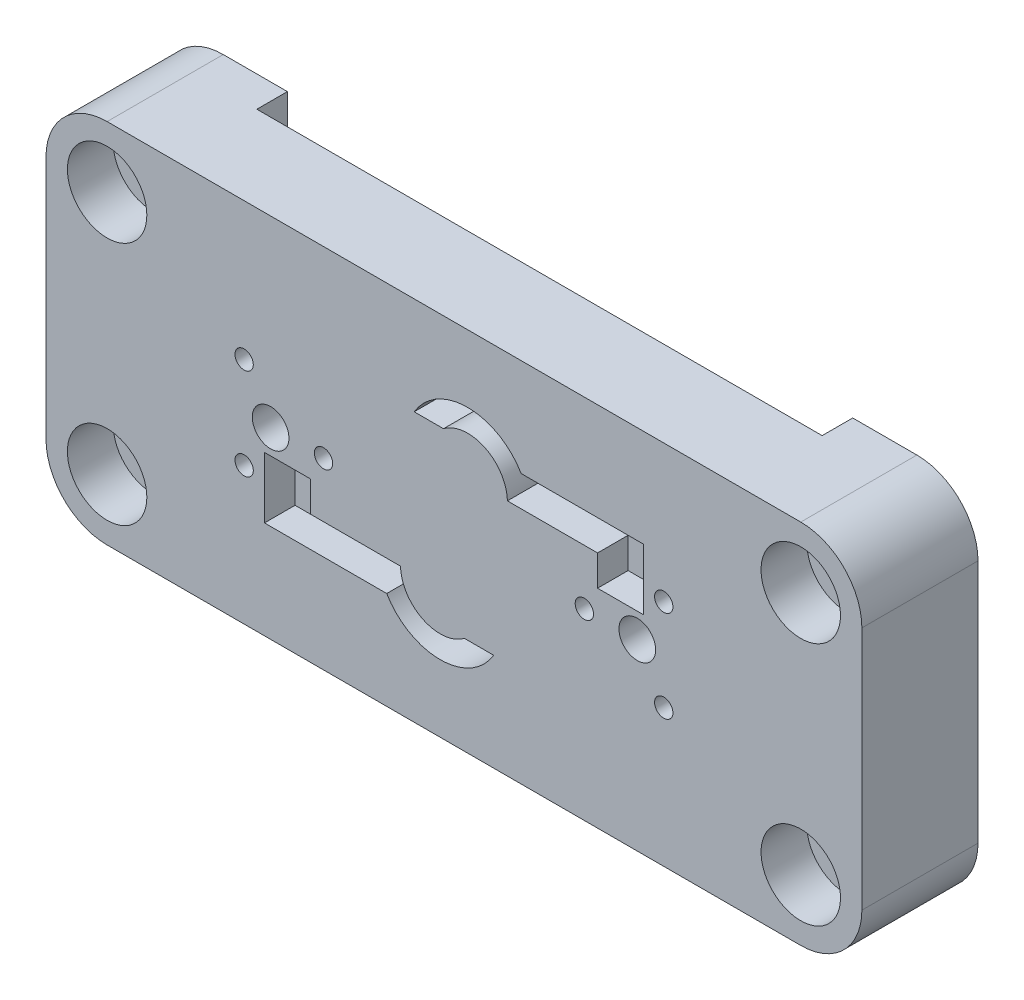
ISO-10303-21;
HEADER;
FILE_DESCRIPTION(('STEP AP214'),'2;1');
FILE_NAME('part.step','',(''),(''),'','','');
FILE_SCHEMA(('AUTOMOTIVE_DESIGN { 1 0 10303 214 1 1 1 1 }'));
ENDSEC;
DATA;
#1=APPLICATION_CONTEXT('core data for automotive mechanical design processes');
#2=APPLICATION_PROTOCOL_DEFINITION('international standard','automotive_design',2000,#1);
#3=PRODUCT_CONTEXT('',#1,'mechanical');
#4=PRODUCT('Part','Part','',(#3));
#5=PRODUCT_RELATED_PRODUCT_CATEGORY('part','',(#4));
#6=PRODUCT_DEFINITION_FORMATION('','',#4);
#7=PRODUCT_DEFINITION_CONTEXT('part definition',#1,'design');
#8=PRODUCT_DEFINITION('design','',#6,#7);
#9=PRODUCT_DEFINITION_SHAPE('','',#8);
#10=(LENGTH_UNIT() NAMED_UNIT(*) SI_UNIT(.MILLI.,.METRE.));
#11=(NAMED_UNIT(*) PLANE_ANGLE_UNIT() SI_UNIT($,.RADIAN.));
#12=(NAMED_UNIT(*) SI_UNIT($,.STERADIAN.) SOLID_ANGLE_UNIT());
#13=UNCERTAINTY_MEASURE_WITH_UNIT(LENGTH_MEASURE(1.E-05),#10,'distance_accuracy_value','');
#14=(GEOMETRIC_REPRESENTATION_CONTEXT(3) GLOBAL_UNCERTAINTY_ASSIGNED_CONTEXT((#13)) GLOBAL_UNIT_ASSIGNED_CONTEXT((#10,
#11,#12)) REPRESENTATION_CONTEXT('',''));
#15=CARTESIAN_POINT('',(0.,0.,0.));
#16=DIRECTION('',(0.,0.,1.));
#17=DIRECTION('',(1.,0.,0.));
#18=AXIS2_PLACEMENT_3D('',#15,#16,#17);
#19=CARTESIAN_POINT('',(-11.25,3.9,1.));
#20=DIRECTION('',(0.,0.,1.));
#21=DIRECTION('',(1.,0.,0.));
#22=AXIS2_PLACEMENT_3D('',#19,#20,#21);
#23=PLANE('',#22);
#24=DIRECTION('',(0.,1.,0.));
#25=VECTOR('',#24,1.);
#26=CARTESIAN_POINT('',(-9.25,6.,1.));
#27=LINE('',#26,#25);
#28=CARTESIAN_POINT('',(-9.25,3.90000000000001,1.));
#29=VERTEX_POINT('',#28);
#30=CARTESIAN_POINT('',(-9.25,6.,1.));
#31=VERTEX_POINT('',#30);
#32=EDGE_CURVE('E531',#29,#31,#27,.T.);
#33=ORIENTED_EDGE('',*,*,#32,.T.);
#34=DIRECTION('',(1.,0.,0.));
#35=VECTOR('',#34,1.);
#36=CARTESIAN_POINT('',(9.25,6.,1.));
#37=LINE('',#36,#35);
#38=CARTESIAN_POINT('',(9.25,6.,1.));
#39=VERTEX_POINT('',#38);
#40=EDGE_CURVE('E534',#31,#39,#37,.T.);
#41=ORIENTED_EDGE('',*,*,#40,.T.);
#42=DIRECTION('',(0.,-1.,0.));
#43=VECTOR('',#42,1.);
#44=CARTESIAN_POINT('',(9.25,6.,1.));
#45=LINE('',#44,#43);
#46=CARTESIAN_POINT('',(9.25,3.90000000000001,1.));
#47=VERTEX_POINT('',#46);
#48=EDGE_CURVE('E537',#39,#47,#45,.T.);
#49=ORIENTED_EDGE('',*,*,#48,.T.);
#50=CARTESIAN_POINT('',(11.25,3.9,1.));
#51=DIRECTION('',(0.,0.,1.));
#52=DIRECTION('',(-1.,0.,0.));
#53=AXIS2_PLACEMENT_3D('',#50,#51,#52);
#54=CIRCLE('',#53,2.);
#55=CARTESIAN_POINT('',(11.25,1.9,1.));
#56=VERTEX_POINT('',#55);
#57=EDGE_CURVE('E540',#47,#56,#54,.T.);
#58=ORIENTED_EDGE('',*,*,#57,.T.);
#59=DIRECTION('',(1.,0.,0.));
#60=VECTOR('',#59,1.);
#61=CARTESIAN_POINT('',(11.25,1.9,1.));
#62=LINE('',#61,#60);
#63=CARTESIAN_POINT('',(11.5,1.9,1.));
#64=VERTEX_POINT('',#63);
#65=EDGE_CURVE('E543',#56,#64,#62,.T.);
#66=ORIENTED_EDGE('',*,*,#65,.T.);
#67=DIRECTION('',(0.,-1.,0.));
#68=VECTOR('',#67,1.);
#69=CARTESIAN_POINT('',(11.5,1.9,1.));
#70=LINE('',#69,#68);
#71=CARTESIAN_POINT('',(11.5,-1.9,1.));
#72=VERTEX_POINT('',#71);
#73=EDGE_CURVE('E546',#64,#72,#70,.T.);
#74=ORIENTED_EDGE('',*,*,#73,.T.);
#75=DIRECTION('',(-1.,0.,0.));
#76=VECTOR('',#75,1.);
#77=CARTESIAN_POINT('',(11.5,-1.9,1.));
#78=LINE('',#77,#76);
#79=CARTESIAN_POINT('',(11.25,-1.9,1.));
#80=VERTEX_POINT('',#79);
#81=EDGE_CURVE('E549',#72,#80,#78,.T.);
#82=ORIENTED_EDGE('',*,*,#81,.T.);
#83=CARTESIAN_POINT('',(11.25,-3.9,1.));
#84=DIRECTION('',(0.,0.,1.));
#85=DIRECTION('',(-1.,0.,0.));
#86=AXIS2_PLACEMENT_3D('',#83,#84,#85);
#87=CIRCLE('',#86,2.);
#88=CARTESIAN_POINT('',(9.25,-3.90000000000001,1.));
#89=VERTEX_POINT('',#88);
#90=EDGE_CURVE('E552',#80,#89,#87,.T.);
#91=ORIENTED_EDGE('',*,*,#90,.T.);
#92=DIRECTION('',(0.,-1.,0.));
#93=VECTOR('',#92,1.);
#94=CARTESIAN_POINT('',(9.25,-3.90000000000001,1.));
#95=LINE('',#94,#93);
#96=CARTESIAN_POINT('',(9.25,-5.99999999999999,1.));
#97=VERTEX_POINT('',#96);
#98=EDGE_CURVE('E555',#89,#97,#95,.T.);
#99=ORIENTED_EDGE('',*,*,#98,.T.);
#100=DIRECTION('',(-1.,0.,0.));
#101=VECTOR('',#100,1.);
#102=CARTESIAN_POINT('',(-9.25,-5.99999999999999,1.));
#103=LINE('',#102,#101);
#104=CARTESIAN_POINT('',(-9.25,-5.99999999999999,1.));
#105=VERTEX_POINT('',#104);
#106=EDGE_CURVE('E558',#97,#105,#103,.T.);
#107=ORIENTED_EDGE('',*,*,#106,.T.);
#108=DIRECTION('',(0.,1.,0.));
#109=VECTOR('',#108,1.);
#110=CARTESIAN_POINT('',(-9.25,-3.90000000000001,1.));
#111=LINE('',#110,#109);
#112=CARTESIAN_POINT('',(-9.25,-3.90000000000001,1.));
#113=VERTEX_POINT('',#112);
#114=EDGE_CURVE('E561',#105,#113,#111,.T.);
#115=ORIENTED_EDGE('',*,*,#114,.T.);
#116=CARTESIAN_POINT('',(-11.25,-3.9,1.));
#117=DIRECTION('',(0.,0.,1.));
#118=DIRECTION('',(1.,0.,0.));
#119=AXIS2_PLACEMENT_3D('',#116,#117,#118);
#120=CIRCLE('',#119,2.);
#121=CARTESIAN_POINT('',(-11.25,-1.9,1.));
#122=VERTEX_POINT('',#121);
#123=EDGE_CURVE('E564',#113,#122,#120,.T.);
#124=ORIENTED_EDGE('',*,*,#123,.T.);
#125=DIRECTION('',(-1.,0.,0.));
#126=VECTOR('',#125,1.);
#127=CARTESIAN_POINT('',(-11.5,-1.9,1.));
#128=LINE('',#127,#126);
#129=CARTESIAN_POINT('',(-11.5,-1.9,1.));
#130=VERTEX_POINT('',#129);
#131=EDGE_CURVE('E567',#122,#130,#128,.T.);
#132=ORIENTED_EDGE('',*,*,#131,.T.);
#133=DIRECTION('',(0.,1.,0.));
#134=VECTOR('',#133,1.);
#135=CARTESIAN_POINT('',(-11.5,1.9,1.));
#136=LINE('',#135,#134);
#137=CARTESIAN_POINT('',(-11.5,1.9,1.));
#138=VERTEX_POINT('',#137);
#139=EDGE_CURVE('E570',#130,#138,#136,.T.);
#140=ORIENTED_EDGE('',*,*,#139,.T.);
#141=DIRECTION('',(1.,0.,0.));
#142=VECTOR('',#141,1.);
#143=CARTESIAN_POINT('',(-11.25,1.9,1.));
#144=LINE('',#143,#142);
#145=CARTESIAN_POINT('',(-11.25,1.9,1.));
#146=VERTEX_POINT('',#145);
#147=EDGE_CURVE('E573',#138,#146,#144,.T.);
#148=ORIENTED_EDGE('',*,*,#147,.T.);
#149=CARTESIAN_POINT('',(-11.25,3.9,1.));
#150=DIRECTION('',(0.,0.,1.));
#151=DIRECTION('',(1.,0.,0.));
#152=AXIS2_PLACEMENT_3D('',#149,#150,#151);
#153=CIRCLE('',#152,2.);
#154=EDGE_CURVE('E576',#146,#29,#153,.T.);
#155=ORIENTED_EDGE('',*,*,#154,.T.);
#156=EDGE_LOOP('',(#33,#41,#49,#58,#66,#74,#82,#91,#99,#107,#115,#124,#132,#140,#148,#155));
#157=FACE_BOUND('',#156,.T.);
#158=CARTESIAN_POINT('',(-6.,0.,1.));
#159=DIRECTION('',(0.,0.,1.));
#160=DIRECTION('',(1.,0.,0.));
#161=AXIS2_PLACEMENT_3D('',#158,#159,#160);
#162=CIRCLE('',#161,2.4);
#163=CARTESIAN_POINT('',(-3.6,0.,1.));
#164=VERTEX_POINT('',#163);
#165=EDGE_CURVE('E41',#164,#164,#162,.F.);
#166=ORIENTED_EDGE('',*,*,#165,.F.);
#167=EDGE_LOOP('',(#166));
#168=FACE_BOUND('',#167,.T.);
#169=CARTESIAN_POINT('',(6.,0.,1.));
#170=DIRECTION('',(0.,0.,1.));
#171=DIRECTION('',(1.,0.,0.));
#172=AXIS2_PLACEMENT_3D('',#169,#170,#171);
#173=CIRCLE('',#172,2.4);
#174=CARTESIAN_POINT('',(8.4,0.,1.));
#175=VERTEX_POINT('',#174);
#176=EDGE_CURVE('E11',#175,#175,#173,.F.);
#177=ORIENTED_EDGE('',*,*,#176,.F.);
#178=EDGE_LOOP('',(#177));
#179=FACE_BOUND('',#178,.T.);
#180=ADVANCED_FACE('F33',(#157,#168,#179),#23,.F.);
#181=CARTESIAN_POINT('',(11.35,4.,0.));
#182=DIRECTION('',(0.,0.,1.));
#183=DIRECTION('',(1.,0.,0.));
#184=AXIS2_PLACEMENT_3D('',#181,#182,#183);
#185=PLANE('',#184);
#186=CARTESIAN_POINT('',(-11.35,-4.,0.));
#187=DIRECTION('',(0.,0.,1.));
#188=DIRECTION('',(1.,0.,0.));
#189=AXIS2_PLACEMENT_3D('',#186,#187,#188);
#190=CIRCLE('',#189,0.749999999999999);
#191=CARTESIAN_POINT('',(-10.6,-4.,0.));
#192=VERTEX_POINT('',#191);
#193=EDGE_CURVE('E649',#192,#192,#190,.T.);
#194=ORIENTED_EDGE('',*,*,#193,.T.);
#195=EDGE_LOOP('',(#194));
#196=FACE_BOUND('',#195,.T.);
#197=CARTESIAN_POINT('',(-11.35,4.,0.));
#198=DIRECTION('',(0.,0.,1.));
#199=DIRECTION('',(1.,0.,0.));
#200=AXIS2_PLACEMENT_3D('',#197,#198,#199);
#201=CIRCLE('',#200,0.749999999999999);
#202=CARTESIAN_POINT('',(-10.6,4.,0.));
#203=VERTEX_POINT('',#202);
#204=EDGE_CURVE('E582',#203,#203,#201,.T.);
#205=ORIENTED_EDGE('',*,*,#204,.T.);
#206=EDGE_LOOP('',(#205));
#207=FACE_BOUND('',#206,.T.);
#208=DIRECTION('',(-1.,0.,0.));
#209=VECTOR('',#208,1.);
#210=CARTESIAN_POINT('',(-11.35,6.,0.));
#211=LINE('',#210,#209);
#212=CARTESIAN_POINT('',(-9.25,6.,0.));
#213=VERTEX_POINT('',#212);
#214=CARTESIAN_POINT('',(-11.35,6.,0.));
#215=VERTEX_POINT('',#214);
#216=EDGE_CURVE('E664',#213,#215,#211,.T.);
#217=ORIENTED_EDGE('',*,*,#216,.F.);
#218=DIRECTION('',(0.,1.,0.));
#219=VECTOR('',#218,1.);
#220=CARTESIAN_POINT('',(-9.25,6.,0.));
#221=LINE('',#220,#219);
#222=CARTESIAN_POINT('',(-9.25,3.90000000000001,0.));
#223=VERTEX_POINT('',#222);
#224=EDGE_CURVE('E491',#223,#213,#221,.T.);
#225=ORIENTED_EDGE('',*,*,#224,.F.);
#226=CARTESIAN_POINT('',(-11.25,3.9,0.));
#227=DIRECTION('',(0.,0.,1.));
#228=DIRECTION('',(1.,0.,0.));
#229=AXIS2_PLACEMENT_3D('',#226,#227,#228);
#230=CIRCLE('',#229,2.);
#231=CARTESIAN_POINT('',(-11.25,1.9,0.));
#232=VERTEX_POINT('',#231);
#233=EDGE_CURVE('E528',#232,#223,#230,.T.);
#234=ORIENTED_EDGE('',*,*,#233,.F.);
#235=DIRECTION('',(1.,0.,0.));
#236=VECTOR('',#235,1.);
#237=CARTESIAN_POINT('',(-11.25,1.9,0.));
#238=LINE('',#237,#236);
#239=CARTESIAN_POINT('',(-11.5,1.9,0.));
#240=VERTEX_POINT('',#239);
#241=EDGE_CURVE('E525',#240,#232,#238,.T.);
#242=ORIENTED_EDGE('',*,*,#241,.F.);
#243=DIRECTION('',(0.,1.,0.));
#244=VECTOR('',#243,1.);
#245=CARTESIAN_POINT('',(-11.5,1.9,0.));
#246=LINE('',#245,#244);
#247=CARTESIAN_POINT('',(-11.5,-1.9,0.));
#248=VERTEX_POINT('',#247);
#249=EDGE_CURVE('E522',#248,#240,#246,.T.);
#250=ORIENTED_EDGE('',*,*,#249,.F.);
#251=DIRECTION('',(-1.,0.,0.));
#252=VECTOR('',#251,1.);
#253=CARTESIAN_POINT('',(-11.5,-1.9,0.));
#254=LINE('',#253,#252);
#255=CARTESIAN_POINT('',(-11.25,-1.9,0.));
#256=VERTEX_POINT('',#255);
#257=EDGE_CURVE('E519',#256,#248,#254,.T.);
#258=ORIENTED_EDGE('',*,*,#257,.F.);
#259=CARTESIAN_POINT('',(-11.25,-3.9,0.));
#260=DIRECTION('',(0.,0.,1.));
#261=DIRECTION('',(1.,0.,0.));
#262=AXIS2_PLACEMENT_3D('',#259,#260,#261);
#263=CIRCLE('',#262,2.);
#264=CARTESIAN_POINT('',(-9.25,-3.90000000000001,0.));
#265=VERTEX_POINT('',#264);
#266=EDGE_CURVE('E516',#265,#256,#263,.T.);
#267=ORIENTED_EDGE('',*,*,#266,.F.);
#268=DIRECTION('',(0.,1.,0.));
#269=VECTOR('',#268,1.);
#270=CARTESIAN_POINT('',(-9.25,-3.90000000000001,0.));
#271=LINE('',#270,#269);
#272=CARTESIAN_POINT('',(-9.25,-5.99999999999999,0.));
#273=VERTEX_POINT('',#272);
#274=EDGE_CURVE('E513',#273,#265,#271,.T.);
#275=ORIENTED_EDGE('',*,*,#274,.F.);
#276=DIRECTION('',(1.,0.,0.));
#277=VECTOR('',#276,1.);
#278=CARTESIAN_POINT('',(-11.35,-6.,0.));
#279=LINE('',#278,#277);
#280=CARTESIAN_POINT('',(-11.35,-6.,0.));
#281=VERTEX_POINT('',#280);
#282=EDGE_CURVE('E675',#281,#273,#279,.T.);
#283=ORIENTED_EDGE('',*,*,#282,.F.);
#284=CARTESIAN_POINT('',(-11.35,-4.,0.));
#285=DIRECTION('',(0.,0.,1.));
#286=DIRECTION('',(1.,0.,0.));
#287=AXIS2_PLACEMENT_3D('',#284,#285,#286);
#288=CIRCLE('',#287,2.);
#289=CARTESIAN_POINT('',(-13.35,-3.99999999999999,0.));
#290=VERTEX_POINT('',#289);
#291=EDGE_CURVE('E672',#290,#281,#288,.T.);
#292=ORIENTED_EDGE('',*,*,#291,.F.);
#293=DIRECTION('',(0.,-1.,0.));
#294=VECTOR('',#293,1.);
#295=CARTESIAN_POINT('',(-13.35,3.99999999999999,0.));
#296=LINE('',#295,#294);
#297=CARTESIAN_POINT('',(-13.35,3.99999999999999,0.));
#298=VERTEX_POINT('',#297);
#299=EDGE_CURVE('E670',#298,#290,#296,.T.);
#300=ORIENTED_EDGE('',*,*,#299,.F.);
#301=CARTESIAN_POINT('',(-11.35,4.,0.));
#302=DIRECTION('',(0.,0.,1.));
#303=DIRECTION('',(1.,0.,0.));
#304=AXIS2_PLACEMENT_3D('',#301,#302,#303);
#305=CIRCLE('',#304,2.);
#306=EDGE_CURVE('E668',#215,#298,#305,.T.);
#307=ORIENTED_EDGE('',*,*,#306,.F.);
#308=EDGE_LOOP('',(#217,#225,#234,#242,#250,#258,#267,#275,#283,#292,#300,#307));
#309=FACE_BOUND('',#308,.T.);
#310=ADVANCED_FACE('F729',(#196,#207,#309),#185,.F.);
#311=CARTESIAN_POINT('',(11.35,4.,3.8));
#312=DIRECTION('',(0.,0.,-1.));
#313=DIRECTION('',(-1.,0.,0.));
#314=AXIS2_PLACEMENT_3D('',#311,#312,#313);
#315=CYLINDRICAL_SURFACE('',#314,2.);
#316=CARTESIAN_POINT('',(11.35,4.,0.));
#317=DIRECTION('',(0.,0.,1.));
#318=DIRECTION('',(1.,0.,0.));
#319=AXIS2_PLACEMENT_3D('',#316,#317,#318);
#320=CIRCLE('',#319,2.);
#321=CARTESIAN_POINT('',(13.35,3.99999999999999,0.));
#322=VERTEX_POINT('',#321);
#323=CARTESIAN_POINT('',(11.35,6.,0.));
#324=VERTEX_POINT('',#323);
#325=EDGE_CURVE('E661',#322,#324,#320,.T.);
#326=ORIENTED_EDGE('',*,*,#325,.T.);
#327=DIRECTION('',(0.,0.,-1.));
#328=VECTOR('',#327,1.);
#329=CARTESIAN_POINT('',(11.35,6.,3.8));
#330=LINE('',#329,#328);
#331=CARTESIAN_POINT('',(11.35,6.,3.8));
#332=VERTEX_POINT('',#331);
#333=EDGE_CURVE('E720',#332,#324,#330,.T.);
#334=ORIENTED_EDGE('',*,*,#333,.F.);
#335=CARTESIAN_POINT('',(11.35,4.,3.8));
#336=DIRECTION('',(0.,0.,1.));
#337=DIRECTION('',(1.,0.,0.));
#338=AXIS2_PLACEMENT_3D('',#335,#336,#337);
#339=CIRCLE('',#338,2.);
#340=CARTESIAN_POINT('',(13.35,3.99999999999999,3.8));
#341=VERTEX_POINT('',#340);
#342=EDGE_CURVE('E682',#341,#332,#339,.T.);
#343=ORIENTED_EDGE('',*,*,#342,.F.);
#344=DIRECTION('',(0.,0.,-1.));
#345=VECTOR('',#344,1.);
#346=CARTESIAN_POINT('',(13.35,3.99999999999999,3.8));
#347=LINE('',#346,#345);
#348=EDGE_CURVE('E699',#341,#322,#347,.T.);
#349=ORIENTED_EDGE('',*,*,#348,.T.);
#350=EDGE_LOOP('',(#326,#334,#343,#349));
#351=FACE_BOUND('',#350,.T.);
#352=ADVANCED_FACE('F35',(#351),#315,.T.);
#353=CARTESIAN_POINT('',(-11.35,6.,3.8));
#354=DIRECTION('',(0.,-1.,0.));
#355=DIRECTION('',(1.,0.,0.));
#356=AXIS2_PLACEMENT_3D('',#353,#354,#355);
#357=PLANE('',#356);
#358=ORIENTED_EDGE('',*,*,#40,.F.);
#359=DIRECTION('',(0.,0.,-1.));
#360=VECTOR('',#359,1.);
#361=CARTESIAN_POINT('',(-9.25,6.,1.));
#362=LINE('',#361,#360);
#363=EDGE_CURVE('E579',#31,#213,#362,.T.);
#364=ORIENTED_EDGE('',*,*,#363,.T.);
#365=ORIENTED_EDGE('',*,*,#216,.T.);
#366=DIRECTION('',(0.,0.,-1.));
#367=VECTOR('',#366,1.);
#368=CARTESIAN_POINT('',(-11.35,6.,3.8));
#369=LINE('',#368,#367);
#370=CARTESIAN_POINT('',(-11.35,6.,3.8));
#371=VERTEX_POINT('',#370);
#372=EDGE_CURVE('E717',#371,#215,#369,.T.);
#373=ORIENTED_EDGE('',*,*,#372,.F.);
#374=DIRECTION('',(-1.,0.,0.));
#375=VECTOR('',#374,1.);
#376=CARTESIAN_POINT('',(-11.35,6.,3.8));
#377=LINE('',#376,#375);
#378=EDGE_CURVE('E685',#332,#371,#377,.T.);
#379=ORIENTED_EDGE('',*,*,#378,.F.);
#380=ORIENTED_EDGE('',*,*,#333,.T.);
#381=CARTESIAN_POINT('',(9.24999999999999,6.,0.));
#382=VERTEX_POINT('',#381);
#383=EDGE_CURVE('E665',#324,#382,#211,.T.);
#384=ORIENTED_EDGE('',*,*,#383,.T.);
#385=DIRECTION('',(0.,0.,-1.));
#386=VECTOR('',#385,1.);
#387=CARTESIAN_POINT('',(9.25,6.,1.));
#388=LINE('',#387,#386);
#389=EDGE_CURVE('E610',#39,#382,#388,.T.);
#390=ORIENTED_EDGE('',*,*,#389,.F.);
#391=EDGE_LOOP('',(#358,#364,#365,#373,#379,#380,#384,#390));
#392=FACE_BOUND('',#391,.T.);
#393=ADVANCED_FACE('F897',(#392),#357,.F.);
#394=CARTESIAN_POINT('',(-11.35,4.,3.8));
#395=DIRECTION('',(0.,0.,-1.));
#396=DIRECTION('',(-1.,0.,0.));
#397=AXIS2_PLACEMENT_3D('',#394,#395,#396);
#398=CYLINDRICAL_SURFACE('',#397,2.);
#399=ORIENTED_EDGE('',*,*,#306,.T.);
#400=DIRECTION('',(0.,0.,-1.));
#401=VECTOR('',#400,1.);
#402=CARTESIAN_POINT('',(-13.35,3.99999999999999,3.8));
#403=LINE('',#402,#401);
#404=CARTESIAN_POINT('',(-13.35,3.99999999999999,3.8));
#405=VERTEX_POINT('',#404);
#406=EDGE_CURVE('E714',#405,#298,#403,.T.);
#407=ORIENTED_EDGE('',*,*,#406,.F.);
#408=CARTESIAN_POINT('',(-11.35,4.,3.8));
#409=DIRECTION('',(0.,0.,1.));
#410=DIRECTION('',(1.,0.,0.));
#411=AXIS2_PLACEMENT_3D('',#408,#409,#410);
#412=CIRCLE('',#411,2.);
#413=EDGE_CURVE('E687',#371,#405,#412,.T.);
#414=ORIENTED_EDGE('',*,*,#413,.F.);
#415=ORIENTED_EDGE('',*,*,#372,.T.);
#416=EDGE_LOOP('',(#399,#407,#414,#415));
#417=FACE_BOUND('',#416,.T.);
#418=ADVANCED_FACE('F894',(#417),#398,.T.);
#419=CARTESIAN_POINT('',(-13.35,3.99999999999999,3.8));
#420=DIRECTION('',(1.,0.,0.));
#421=DIRECTION('',(0.,0.,-1.));
#422=AXIS2_PLACEMENT_3D('',#419,#420,#421);
#423=PLANE('',#422);
#424=ORIENTED_EDGE('',*,*,#299,.T.);
#425=DIRECTION('',(0.,0.,-1.));
#426=VECTOR('',#425,1.);
#427=CARTESIAN_POINT('',(-13.35,-3.99999999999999,3.8));
#428=LINE('',#427,#426);
#429=CARTESIAN_POINT('',(-13.35,-3.99999999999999,3.8));
#430=VERTEX_POINT('',#429);
#431=EDGE_CURVE('E711',#430,#290,#428,.T.);
#432=ORIENTED_EDGE('',*,*,#431,.F.);
#433=DIRECTION('',(0.,-1.,0.));
#434=VECTOR('',#433,1.);
#435=CARTESIAN_POINT('',(-13.35,3.99999999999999,3.8));
#436=LINE('',#435,#434);
#437=EDGE_CURVE('E689',#405,#430,#436,.T.);
#438=ORIENTED_EDGE('',*,*,#437,.F.);
#439=ORIENTED_EDGE('',*,*,#406,.T.);
#440=EDGE_LOOP('',(#424,#432,#438,#439));
#441=FACE_BOUND('',#440,.T.);
#442=ADVANCED_FACE('F890',(#441),#423,.F.);
#443=CARTESIAN_POINT('',(-11.35,-4.,3.8));
#444=DIRECTION('',(0.,0.,-1.));
#445=DIRECTION('',(-1.,0.,0.));
#446=AXIS2_PLACEMENT_3D('',#443,#444,#445);
#447=CYLINDRICAL_SURFACE('',#446,2.);
#448=ORIENTED_EDGE('',*,*,#291,.T.);
#449=DIRECTION('',(0.,0.,-1.));
#450=VECTOR('',#449,1.);
#451=CARTESIAN_POINT('',(-11.35,-6.,3.8));
#452=LINE('',#451,#450);
#453=CARTESIAN_POINT('',(-11.35,-6.,3.8));
#454=VERTEX_POINT('',#453);
#455=EDGE_CURVE('E708',#454,#281,#452,.T.);
#456=ORIENTED_EDGE('',*,*,#455,.F.);
#457=CARTESIAN_POINT('',(-11.35,-4.,3.8));
#458=DIRECTION('',(0.,0.,1.));
#459=DIRECTION('',(1.,0.,0.));
#460=AXIS2_PLACEMENT_3D('',#457,#458,#459);
#461=CIRCLE('',#460,2.);
#462=EDGE_CURVE('E691',#430,#454,#461,.T.);
#463=ORIENTED_EDGE('',*,*,#462,.F.);
#464=ORIENTED_EDGE('',*,*,#431,.T.);
#465=EDGE_LOOP('',(#448,#456,#463,#464));
#466=FACE_BOUND('',#465,.T.);
#467=ADVANCED_FACE('F886',(#466),#447,.T.);
#468=CARTESIAN_POINT('',(-11.35,-6.,3.8));
#469=DIRECTION('',(0.,1.,0.));
#470=DIRECTION('',(-1.,0.,0.));
#471=AXIS2_PLACEMENT_3D('',#468,#469,#470);
#472=PLANE('',#471);
#473=ORIENTED_EDGE('',*,*,#282,.T.);
#474=DIRECTION('',(0.,0.,-1.));
#475=VECTOR('',#474,1.);
#476=CARTESIAN_POINT('',(-9.25,-5.99999999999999,1.));
#477=LINE('',#476,#475);
#478=EDGE_CURVE('E593',#105,#273,#477,.T.);
#479=ORIENTED_EDGE('',*,*,#478,.F.);
#480=ORIENTED_EDGE('',*,*,#106,.F.);
#481=DIRECTION('',(0.,0.,-1.));
#482=VECTOR('',#481,1.);
#483=CARTESIAN_POINT('',(9.25,-5.99999999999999,1.));
#484=LINE('',#483,#482);
#485=CARTESIAN_POINT('',(9.25,-5.99999999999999,0.));
#486=VERTEX_POINT('',#485);
#487=EDGE_CURVE('E595',#97,#486,#484,.T.);
#488=ORIENTED_EDGE('',*,*,#487,.T.);
#489=CARTESIAN_POINT('',(11.35,-6.,0.));
#490=VERTEX_POINT('',#489);
#491=EDGE_CURVE('E674',#486,#490,#279,.T.);
#492=ORIENTED_EDGE('',*,*,#491,.T.);
#493=DIRECTION('',(0.,0.,-1.));
#494=VECTOR('',#493,1.);
#495=CARTESIAN_POINT('',(11.35,-6.,3.8));
#496=LINE('',#495,#494);
#497=CARTESIAN_POINT('',(11.35,-6.,3.8));
#498=VERTEX_POINT('',#497);
#499=EDGE_CURVE('E705',#498,#490,#496,.T.);
#500=ORIENTED_EDGE('',*,*,#499,.F.);
#501=DIRECTION('',(1.,0.,0.));
#502=VECTOR('',#501,1.);
#503=CARTESIAN_POINT('',(-11.35,-6.,3.8));
#504=LINE('',#503,#502);
#505=EDGE_CURVE('E693',#454,#498,#504,.T.);
#506=ORIENTED_EDGE('',*,*,#505,.F.);
#507=ORIENTED_EDGE('',*,*,#455,.T.);
#508=EDGE_LOOP('',(#473,#479,#480,#488,#492,#500,#506,#507));
#509=FACE_BOUND('',#508,.T.);
#510=ADVANCED_FACE('F882',(#509),#472,.F.);
#511=CARTESIAN_POINT('',(11.35,-4.,3.8));
#512=DIRECTION('',(0.,0.,-1.));
#513=DIRECTION('',(-1.,0.,0.));
#514=AXIS2_PLACEMENT_3D('',#511,#512,#513);
#515=CYLINDRICAL_SURFACE('',#514,2.);
#516=CARTESIAN_POINT('',(11.35,-4.,0.));
#517=DIRECTION('',(0.,0.,1.));
#518=DIRECTION('',(1.,0.,0.));
#519=AXIS2_PLACEMENT_3D('',#516,#517,#518);
#520=CIRCLE('',#519,2.);
#521=CARTESIAN_POINT('',(13.35,-3.99999999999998,0.));
#522=VERTEX_POINT('',#521);
#523=EDGE_CURVE('E678',#490,#522,#520,.T.);
#524=ORIENTED_EDGE('',*,*,#523,.T.);
#525=DIRECTION('',(0.,0.,-1.));
#526=VECTOR('',#525,1.);
#527=CARTESIAN_POINT('',(13.35,-3.99999999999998,3.8));
#528=LINE('',#527,#526);
#529=CARTESIAN_POINT('',(13.35,-3.99999999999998,3.8));
#530=VERTEX_POINT('',#529);
#531=EDGE_CURVE('E702',#530,#522,#528,.T.);
#532=ORIENTED_EDGE('',*,*,#531,.F.);
#533=CARTESIAN_POINT('',(11.35,-4.,3.8));
#534=DIRECTION('',(0.,0.,1.));
#535=DIRECTION('',(1.,0.,0.));
#536=AXIS2_PLACEMENT_3D('',#533,#534,#535);
#537=CIRCLE('',#536,2.);
#538=EDGE_CURVE('E695',#498,#530,#537,.T.);
#539=ORIENTED_EDGE('',*,*,#538,.F.);
#540=ORIENTED_EDGE('',*,*,#499,.T.);
#541=EDGE_LOOP('',(#524,#532,#539,#540));
#542=FACE_BOUND('',#541,.T.);
#543=ADVANCED_FACE('F878',(#542),#515,.T.);
#544=CARTESIAN_POINT('',(13.35,3.99999999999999,3.8));
#545=DIRECTION('',(-1.,0.,0.));
#546=DIRECTION('',(0.,0.,1.));
#547=AXIS2_PLACEMENT_3D('',#544,#545,#546);
#548=PLANE('',#547);
#549=DIRECTION('',(0.,1.,0.));
#550=VECTOR('',#549,1.);
#551=CARTESIAN_POINT('',(13.35,3.99999999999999,0.));
#552=LINE('',#551,#550);
#553=EDGE_CURVE('E680',#522,#322,#552,.T.);
#554=ORIENTED_EDGE('',*,*,#553,.T.);
#555=ORIENTED_EDGE('',*,*,#348,.F.);
#556=DIRECTION('',(0.,1.,0.));
#557=VECTOR('',#556,1.);
#558=CARTESIAN_POINT('',(13.35,3.99999999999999,3.8));
#559=LINE('',#558,#557);
#560=EDGE_CURVE('E697',#530,#341,#559,.T.);
#561=ORIENTED_EDGE('',*,*,#560,.F.);
#562=ORIENTED_EDGE('',*,*,#531,.T.);
#563=EDGE_LOOP('',(#554,#555,#561,#562));
#564=FACE_BOUND('',#563,.T.);
#565=ADVANCED_FACE('F875',(#564),#548,.F.);
#566=CARTESIAN_POINT('',(11.35,4.,3.8));
#567=DIRECTION('',(0.,0.,1.));
#568=DIRECTION('',(1.,0.,0.));
#569=AXIS2_PLACEMENT_3D('',#566,#567,#568);
#570=PLANE('',#569);
#571=DIRECTION('',(1.,0.,0.));
#572=VECTOR('',#571,1.);
#573=CARTESIAN_POINT('',(4.69999999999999,0.800000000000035,3.8));
#574=LINE('',#573,#572);
#575=CARTESIAN_POINT('',(4.69999999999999,0.800000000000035,3.8));
#576=VERTEX_POINT('',#575);
#577=CARTESIAN_POINT('',(6.19999999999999,0.800000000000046,3.8));
#578=VERTEX_POINT('',#577);
#579=EDGE_CURVE('E48',#576,#578,#574,.T.);
#580=ORIENTED_EDGE('',*,*,#579,.F.);
#581=DIRECTION('',(0.,-1.,0.));
#582=VECTOR('',#581,1.);
#583=CARTESIAN_POINT('',(4.69999999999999,1.80000000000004,3.8));
#584=LINE('',#583,#582);
#585=CARTESIAN_POINT('',(4.69999999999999,1.80000000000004,3.8));
#586=VERTEX_POINT('',#585);
#587=EDGE_CURVE('E327',#586,#576,#584,.T.);
#588=ORIENTED_EDGE('',*,*,#587,.F.);
#589=DIRECTION('',(1.,0.,0.));
#590=VECTOR('',#589,1.);
#591=CARTESIAN_POINT('',(1.74962434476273,1.80000000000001,3.8));
#592=LINE('',#591,#590);
#593=CARTESIAN_POINT('',(1.74962434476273,1.80000000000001,3.8));
#594=VERTEX_POINT('',#593);
#595=EDGE_CURVE('E324',#594,#586,#592,.T.);
#596=ORIENTED_EDGE('',*,*,#595,.F.);
#597=CARTESIAN_POINT('',(0.449999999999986,1.76875000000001,3.8));
#598=DIRECTION('',(0.,0.,-1.));
#599=DIRECTION('',(-1.,0.,0.));
#600=AXIS2_PLACEMENT_3D('',#597,#598,#599);
#601=CIRCLE('',#600,1.3);
#602=CARTESIAN_POINT('',(-0.341532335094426,2.8,3.8));
#603=VERTEX_POINT('',#602);
#604=EDGE_CURVE('E321',#603,#594,#601,.T.);
#605=ORIENTED_EDGE('',*,*,#604,.F.);
#606=DIRECTION('',(1.,0.,0.));
#607=VECTOR('',#606,1.);
#608=CARTESIAN_POINT('',(-0.341532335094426,2.8,3.8));
#609=LINE('',#608,#607);
#610=CARTESIAN_POINT('',(-1.30000000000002,2.79999999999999,3.8));
#611=VERTEX_POINT('',#610);
#612=EDGE_CURVE('E315',#611,#603,#609,.T.);
#613=ORIENTED_EDGE('',*,*,#612,.F.);
#614=CARTESIAN_POINT('',(0.449999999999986,1.76875000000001,3.8));
#615=DIRECTION('',(0.,0.,1.));
#616=DIRECTION('',(-1.,0.,0.));
#617=AXIS2_PLACEMENT_3D('',#614,#615,#616);
#618=CIRCLE('',#617,2.03125);
#619=CARTESIAN_POINT('',(2.19999999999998,2.80000000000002,3.8));
#620=VERTEX_POINT('',#619);
#621=EDGE_CURVE('E313',#620,#611,#618,.T.);
#622=ORIENTED_EDGE('',*,*,#621,.F.);
#623=DIRECTION('',(-1.,0.,0.));
#624=VECTOR('',#623,1.);
#625=CARTESIAN_POINT('',(6.19999999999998,2.80000000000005,3.8));
#626=LINE('',#625,#624);
#627=CARTESIAN_POINT('',(6.19999999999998,2.80000000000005,3.8));
#628=VERTEX_POINT('',#627);
#629=EDGE_CURVE('E294',#628,#620,#626,.T.);
#630=ORIENTED_EDGE('',*,*,#629,.F.);
#631=DIRECTION('',(0.,1.,0.));
#632=VECTOR('',#631,1.);
#633=CARTESIAN_POINT('',(6.19999999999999,0.800000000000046,3.8));
#634=LINE('',#633,#632);
#635=EDGE_CURVE('E305',#578,#628,#634,.T.);
#636=ORIENTED_EDGE('',*,*,#635,.F.);
#637=EDGE_LOOP('',(#580,#588,#596,#605,#613,#622,#630,#636));
#638=FACE_BOUND('',#637,.T.);
#639=DIRECTION('',(-1.,0.,0.));
#640=VECTOR('',#639,1.);
#641=CARTESIAN_POINT('',(-4.7,-0.800000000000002,3.8));
#642=LINE('',#641,#640);
#643=CARTESIAN_POINT('',(-4.7,-0.800000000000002,3.8));
#644=VERTEX_POINT('',#643);
#645=CARTESIAN_POINT('',(-6.2,-0.800000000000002,3.8));
#646=VERTEX_POINT('',#645);
#647=EDGE_CURVE('E56',#644,#646,#642,.T.);
#648=ORIENTED_EDGE('',*,*,#647,.F.);
#649=DIRECTION('',(0.,1.,0.));
#650=VECTOR('',#649,1.);
#651=CARTESIAN_POINT('',(-4.7,-1.8,3.8));
#652=LINE('',#651,#650);
#653=CARTESIAN_POINT('',(-4.7,-1.8,3.8));
#654=VERTEX_POINT('',#653);
#655=EDGE_CURVE('E382',#654,#644,#652,.T.);
#656=ORIENTED_EDGE('',*,*,#655,.F.);
#657=DIRECTION('',(-1.,0.,0.));
#658=VECTOR('',#657,1.);
#659=CARTESIAN_POINT('',(-1.74962434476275,-1.8,3.8));
#660=LINE('',#659,#658);
#661=CARTESIAN_POINT('',(-1.74962434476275,-1.8,3.8));
#662=VERTEX_POINT('',#661);
#663=EDGE_CURVE('E379',#662,#654,#660,.T.);
#664=ORIENTED_EDGE('',*,*,#663,.F.);
#665=CARTESIAN_POINT('',(-0.449999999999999,-1.76875,3.8));
#666=DIRECTION('',(0.,0.,-1.));
#667=DIRECTION('',(1.,0.,0.));
#668=AXIS2_PLACEMENT_3D('',#665,#666,#667);
#669=CIRCLE('',#668,1.3);
#670=CARTESIAN_POINT('',(0.341532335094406,-2.8,3.8));
#671=VERTEX_POINT('',#670);
#672=EDGE_CURVE('E376',#671,#662,#669,.T.);
#673=ORIENTED_EDGE('',*,*,#672,.F.);
#674=DIRECTION('',(-1.,0.,0.));
#675=VECTOR('',#674,1.);
#676=CARTESIAN_POINT('',(0.341532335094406,-2.8,3.8));
#677=LINE('',#676,#675);
#678=CARTESIAN_POINT('',(1.3,-2.8,3.8));
#679=VERTEX_POINT('',#678);
#680=EDGE_CURVE('E373',#679,#671,#677,.T.);
#681=ORIENTED_EDGE('',*,*,#680,.F.);
#682=CARTESIAN_POINT('',(-0.449999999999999,-1.76875,3.8));
#683=DIRECTION('',(0.,0.,1.));
#684=DIRECTION('',(1.,0.,0.));
#685=AXIS2_PLACEMENT_3D('',#682,#683,#684);
#686=CIRCLE('',#685,2.03125);
#687=CARTESIAN_POINT('',(-2.2,-2.8,3.8));
#688=VERTEX_POINT('',#687);
#689=EDGE_CURVE('E370',#688,#679,#686,.T.);
#690=ORIENTED_EDGE('',*,*,#689,.F.);
#691=DIRECTION('',(1.,0.,0.));
#692=VECTOR('',#691,1.);
#693=CARTESIAN_POINT('',(-6.2,-2.8,3.8));
#694=LINE('',#693,#692);
#695=CARTESIAN_POINT('',(-6.2,-2.8,3.8));
#696=VERTEX_POINT('',#695);
#697=EDGE_CURVE('E367',#696,#688,#694,.T.);
#698=ORIENTED_EDGE('',*,*,#697,.F.);
#699=DIRECTION('',(0.,-1.,0.));
#700=VECTOR('',#699,1.);
#701=CARTESIAN_POINT('',(-6.2,-0.800000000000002,3.8));
#702=LINE('',#701,#700);
#703=EDGE_CURVE('E364',#646,#696,#702,.T.);
#704=ORIENTED_EDGE('',*,*,#703,.F.);
#705=EDGE_LOOP('',(#648,#656,#664,#673,#681,#690,#698,#704));
#706=FACE_BOUND('',#705,.T.);
#707=CARTESIAN_POINT('',(-6.86602540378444,1.5,3.8));
#708=DIRECTION('',(0.,0.,-1.));
#709=DIRECTION('',(1.,0.,0.));
#710=AXIS2_PLACEMENT_3D('',#707,#708,#709);
#711=CIRCLE('',#710,0.299999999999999);
#712=CARTESIAN_POINT('',(-6.56602540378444,1.5,3.8));
#713=VERTEX_POINT('',#712);
#714=EDGE_CURVE('E428',#713,#713,#711,.T.);
#715=ORIENTED_EDGE('',*,*,#714,.T.);
#716=EDGE_LOOP('',(#715));
#717=FACE_BOUND('',#716,.T.);
#718=CARTESIAN_POINT('',(-6.,0.,3.8));
#719=DIRECTION('',(0.,0.,-1.));
#720=DIRECTION('',(1.,0.,0.));
#721=AXIS2_PLACEMENT_3D('',#718,#719,#720);
#722=CIRCLE('',#721,0.6);
#723=CARTESIAN_POINT('',(-5.4,0.,3.8));
#724=VERTEX_POINT('',#723);
#725=EDGE_CURVE('E434',#724,#724,#722,.T.);
#726=ORIENTED_EDGE('',*,*,#725,.T.);
#727=EDGE_LOOP('',(#726));
#728=FACE_BOUND('',#727,.T.);
#729=CARTESIAN_POINT('',(-6.86602540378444,-1.5,3.8));
#730=DIRECTION('',(0.,0.,-1.));
#731=DIRECTION('',(1.,0.,0.));
#732=AXIS2_PLACEMENT_3D('',#729,#730,#731);
#733=CIRCLE('',#732,0.3);
#734=CARTESIAN_POINT('',(-6.56602540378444,-1.5,3.8));
#735=VERTEX_POINT('',#734);
#736=EDGE_CURVE('E440',#735,#735,#733,.T.);
#737=ORIENTED_EDGE('',*,*,#736,.T.);
#738=EDGE_LOOP('',(#737));
#739=FACE_BOUND('',#738,.T.);
#740=CARTESIAN_POINT('',(-4.26794919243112,0.,3.8));
#741=DIRECTION('',(0.,0.,-1.));
#742=DIRECTION('',(1.,0.,0.));
#743=AXIS2_PLACEMENT_3D('',#740,#741,#742);
#744=CIRCLE('',#743,0.3);
#745=CARTESIAN_POINT('',(-3.96794919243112,0.,3.8));
#746=VERTEX_POINT('',#745);
#747=EDGE_CURVE('E446',#746,#746,#744,.T.);
#748=ORIENTED_EDGE('',*,*,#747,.T.);
#749=EDGE_LOOP('',(#748));
#750=FACE_BOUND('',#749,.T.);
#751=CARTESIAN_POINT('',(6.86602540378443,-1.50000000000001,3.8));
#752=DIRECTION('',(0.,0.,-1.));
#753=DIRECTION('',(-1.,0.,0.));
#754=AXIS2_PLACEMENT_3D('',#751,#752,#753);
#755=CIRCLE('',#754,0.3);
#756=CARTESIAN_POINT('',(6.56602540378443,-1.50000000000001,3.8));
#757=VERTEX_POINT('',#756);
#758=EDGE_CURVE('E452',#757,#757,#755,.T.);
#759=ORIENTED_EDGE('',*,*,#758,.T.);
#760=EDGE_LOOP('',(#759));
#761=FACE_BOUND('',#760,.T.);
#762=CARTESIAN_POINT('',(6.86602540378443,1.5,3.8));
#763=DIRECTION('',(0.,0.,-1.));
#764=DIRECTION('',(-1.,0.,0.));
#765=AXIS2_PLACEMENT_3D('',#762,#763,#764);
#766=CIRCLE('',#765,0.299999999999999);
#767=CARTESIAN_POINT('',(6.56602540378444,1.5,3.8));
#768=VERTEX_POINT('',#767);
#769=EDGE_CURVE('E458',#768,#768,#766,.T.);
#770=ORIENTED_EDGE('',*,*,#769,.T.);
#771=EDGE_LOOP('',(#770));
#772=FACE_BOUND('',#771,.T.);
#773=CARTESIAN_POINT('',(4.26794919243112,0.,3.8));
#774=DIRECTION('',(0.,0.,-1.));
#775=DIRECTION('',(-1.,0.,0.));
#776=AXIS2_PLACEMENT_3D('',#773,#774,#775);
#777=CIRCLE('',#776,0.300000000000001);
#778=CARTESIAN_POINT('',(3.96794919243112,0.,3.8));
#779=VERTEX_POINT('',#778);
#780=EDGE_CURVE('E464',#779,#779,#777,.T.);
#781=ORIENTED_EDGE('',*,*,#780,.T.);
#782=EDGE_LOOP('',(#781));
#783=FACE_BOUND('',#782,.T.);
#784=CARTESIAN_POINT('',(6.,0.,3.8));
#785=DIRECTION('',(0.,0.,-1.));
#786=DIRECTION('',(-1.,0.,0.));
#787=AXIS2_PLACEMENT_3D('',#784,#785,#786);
#788=CIRCLE('',#787,0.6);
#789=CARTESIAN_POINT('',(5.4,0.,3.8));
#790=VERTEX_POINT('',#789);
#791=EDGE_CURVE('E470',#790,#790,#788,.T.);
#792=ORIENTED_EDGE('',*,*,#791,.T.);
#793=EDGE_LOOP('',(#792));
#794=FACE_BOUND('',#793,.T.);
#795=CARTESIAN_POINT('',(-11.35,4.,3.8));
#796=DIRECTION('',(0.,0.,1.));
#797=DIRECTION('',(1.,0.,0.));
#798=AXIS2_PLACEMENT_3D('',#795,#796,#797);
#799=CIRCLE('',#798,1.3);
#800=CARTESIAN_POINT('',(-10.05,4.,3.8));
#801=VERTEX_POINT('',#800);
#802=EDGE_CURVE('E622',#801,#801,#799,.T.);
#803=ORIENTED_EDGE('',*,*,#802,.F.);
#804=EDGE_LOOP('',(#803));
#805=FACE_BOUND('',#804,.T.);
#806=CARTESIAN_POINT('',(11.35,-4.,3.8));
#807=DIRECTION('',(0.,0.,1.));
#808=DIRECTION('',(1.,0.,0.));
#809=AXIS2_PLACEMENT_3D('',#806,#807,#808);
#810=CIRCLE('',#809,1.3);
#811=CARTESIAN_POINT('',(12.65,-4.,3.8));
#812=VERTEX_POINT('',#811);
#813=EDGE_CURVE('E634',#812,#812,#810,.T.);
#814=ORIENTED_EDGE('',*,*,#813,.F.);
#815=EDGE_LOOP('',(#814));
#816=FACE_BOUND('',#815,.T.);
#817=CARTESIAN_POINT('',(11.35,4.,3.8));
#818=DIRECTION('',(0.,0.,1.));
#819=DIRECTION('',(1.,0.,0.));
#820=AXIS2_PLACEMENT_3D('',#817,#818,#819);
#821=CIRCLE('',#820,1.3);
#822=CARTESIAN_POINT('',(12.65,4.,3.8));
#823=VERTEX_POINT('',#822);
#824=EDGE_CURVE('E646',#823,#823,#821,.T.);
#825=ORIENTED_EDGE('',*,*,#824,.F.);
#826=EDGE_LOOP('',(#825));
#827=FACE_BOUND('',#826,.T.);
#828=CARTESIAN_POINT('',(-11.35,-4.,3.8));
#829=DIRECTION('',(0.,0.,1.));
#830=DIRECTION('',(1.,0.,0.));
#831=AXIS2_PLACEMENT_3D('',#828,#829,#830);
#832=CIRCLE('',#831,1.3);
#833=CARTESIAN_POINT('',(-10.05,-4.,3.8));
#834=VERTEX_POINT('',#833);
#835=EDGE_CURVE('E658',#834,#834,#832,.T.);
#836=ORIENTED_EDGE('',*,*,#835,.F.);
#837=EDGE_LOOP('',(#836));
#838=FACE_BOUND('',#837,.T.);
#839=ORIENTED_EDGE('',*,*,#342,.T.);
#840=ORIENTED_EDGE('',*,*,#378,.T.);
#841=ORIENTED_EDGE('',*,*,#413,.T.);
#842=ORIENTED_EDGE('',*,*,#437,.T.);
#843=ORIENTED_EDGE('',*,*,#462,.T.);
#844=ORIENTED_EDGE('',*,*,#505,.T.);
#845=ORIENTED_EDGE('',*,*,#538,.T.);
#846=ORIENTED_EDGE('',*,*,#560,.T.);
#847=EDGE_LOOP('',(#839,#840,#841,#842,#843,#844,#845,#846));
#848=FACE_BOUND('',#847,.T.);
#849=ADVANCED_FACE('F309',(#638,#706,#717,#728,#739,#750,#761,#772,#783,#794,#805,#816,#827,
#838,#848),#570,.T.);
#850=CARTESIAN_POINT('',(11.35,-4.,0.));
#851=DIRECTION('',(0.,0.,1.));
#852=DIRECTION('',(1.,0.,0.));
#853=AXIS2_PLACEMENT_3D('',#850,#851,#852);
#854=CIRCLE('',#853,0.749999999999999);
#855=CARTESIAN_POINT('',(12.1,-4.,0.));
#856=VERTEX_POINT('',#855);
#857=EDGE_CURVE('E625',#856,#856,#854,.T.);
#858=ORIENTED_EDGE('',*,*,#857,.T.);
#859=EDGE_LOOP('',(#858));
#860=FACE_BOUND('',#859,.T.);
#861=CARTESIAN_POINT('',(11.35,4.,0.));
#862=DIRECTION('',(0.,0.,1.));
#863=DIRECTION('',(1.,0.,0.));
#864=AXIS2_PLACEMENT_3D('',#861,#862,#863);
#865=CIRCLE('',#864,0.749999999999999);
#866=CARTESIAN_POINT('',(12.1,4.,0.));
#867=VERTEX_POINT('',#866);
#868=EDGE_CURVE('E637',#867,#867,#865,.T.);
#869=ORIENTED_EDGE('',*,*,#868,.T.);
#870=EDGE_LOOP('',(#869));
#871=FACE_BOUND('',#870,.T.);
#872=ORIENTED_EDGE('',*,*,#491,.F.);
#873=DIRECTION('',(0.,-1.,0.));
#874=VECTOR('',#873,1.);
#875=CARTESIAN_POINT('',(9.25,-3.90000000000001,0.));
#876=LINE('',#875,#874);
#877=CARTESIAN_POINT('',(9.25,-3.90000000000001,0.));
#878=VERTEX_POINT('',#877);
#879=EDGE_CURVE('E511',#878,#486,#876,.T.);
#880=ORIENTED_EDGE('',*,*,#879,.F.);
#881=CARTESIAN_POINT('',(11.25,-3.9,0.));
#882=DIRECTION('',(0.,0.,1.));
#883=DIRECTION('',(-1.,0.,0.));
#884=AXIS2_PLACEMENT_3D('',#881,#882,#883);
#885=CIRCLE('',#884,2.);
#886=CARTESIAN_POINT('',(11.25,-1.9,0.));
#887=VERTEX_POINT('',#886);
#888=EDGE_CURVE('E508',#887,#878,#885,.T.);
#889=ORIENTED_EDGE('',*,*,#888,.F.);
#890=DIRECTION('',(-1.,0.,0.));
#891=VECTOR('',#890,1.);
#892=CARTESIAN_POINT('',(11.5,-1.9,0.));
#893=LINE('',#892,#891);
#894=CARTESIAN_POINT('',(11.5,-1.9,0.));
#895=VERTEX_POINT('',#894);
#896=EDGE_CURVE('E505',#895,#887,#893,.T.);
#897=ORIENTED_EDGE('',*,*,#896,.F.);
#898=DIRECTION('',(0.,-1.,0.));
#899=VECTOR('',#898,1.);
#900=CARTESIAN_POINT('',(11.5,1.9,0.));
#901=LINE('',#900,#899);
#902=CARTESIAN_POINT('',(11.5,1.9,0.));
#903=VERTEX_POINT('',#902);
#904=EDGE_CURVE('E502',#903,#895,#901,.T.);
#905=ORIENTED_EDGE('',*,*,#904,.F.);
#906=DIRECTION('',(1.,0.,0.));
#907=VECTOR('',#906,1.);
#908=CARTESIAN_POINT('',(11.25,1.9,0.));
#909=LINE('',#908,#907);
#910=CARTESIAN_POINT('',(11.25,1.9,0.));
#911=VERTEX_POINT('',#910);
#912=EDGE_CURVE('E499',#911,#903,#909,.T.);
#913=ORIENTED_EDGE('',*,*,#912,.F.);
#914=CARTESIAN_POINT('',(11.25,3.9,0.));
#915=DIRECTION('',(0.,0.,1.));
#916=DIRECTION('',(-1.,0.,0.));
#917=AXIS2_PLACEMENT_3D('',#914,#915,#916);
#918=CIRCLE('',#917,2.);
#919=CARTESIAN_POINT('',(9.25,3.90000000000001,0.));
#920=VERTEX_POINT('',#919);
#921=EDGE_CURVE('E496',#920,#911,#918,.T.);
#922=ORIENTED_EDGE('',*,*,#921,.F.);
#923=DIRECTION('',(0.,-1.,0.));
#924=VECTOR('',#923,1.);
#925=CARTESIAN_POINT('',(9.25,6.,0.));
#926=LINE('',#925,#924);
#927=EDGE_CURVE('E493',#382,#920,#926,.T.);
#928=ORIENTED_EDGE('',*,*,#927,.F.);
#929=ORIENTED_EDGE('',*,*,#383,.F.);
#930=ORIENTED_EDGE('',*,*,#325,.F.);
#931=ORIENTED_EDGE('',*,*,#553,.F.);
#932=ORIENTED_EDGE('',*,*,#523,.F.);
#933=EDGE_LOOP('',(#872,#880,#889,#897,#905,#913,#922,#928,#929,#930,#931,#932));
#934=FACE_BOUND('',#933,.T.);
#935=ADVANCED_FACE('F868',(#860,#871,#934),#185,.F.);
#936=CARTESIAN_POINT('',(-11.35,-4.,3.8));
#937=DIRECTION('',(0.,0.,1.));
#938=DIRECTION('',(1.,0.,0.));
#939=AXIS2_PLACEMENT_3D('',#936,#937,#938);
#940=CYLINDRICAL_SURFACE('',#939,1.3);
#941=CARTESIAN_POINT('',(-11.35,-4.,2.3));
#942=DIRECTION('',(0.,0.,1.));
#943=DIRECTION('',(1.,0.,0.));
#944=AXIS2_PLACEMENT_3D('',#941,#942,#943);
#945=CIRCLE('',#944,1.3);
#946=CARTESIAN_POINT('',(-10.05,-4.,2.3));
#947=VERTEX_POINT('',#946);
#948=EDGE_CURVE('E655',#947,#947,#945,.T.);
#949=ORIENTED_EDGE('',*,*,#948,.F.);
#950=EDGE_LOOP('',(#949));
#951=FACE_BOUND('',#950,.T.);
#952=ORIENTED_EDGE('',*,*,#835,.T.);
#953=EDGE_LOOP('',(#952));
#954=FACE_BOUND('',#953,.T.);
#955=ADVANCED_FACE('F864',(#951,#954),#940,.F.);
#956=CARTESIAN_POINT('',(-10.6,-4.,2.3));
#957=DIRECTION('',(0.,0.,-1.));
#958=DIRECTION('',(-1.,0.,0.));
#959=AXIS2_PLACEMENT_3D('',#956,#957,#958);
#960=PLANE('',#959);
#961=CARTESIAN_POINT('',(-11.35,-4.,2.3));
#962=DIRECTION('',(0.,0.,1.));
#963=DIRECTION('',(1.,0.,0.));
#964=AXIS2_PLACEMENT_3D('',#961,#962,#963);
#965=CIRCLE('',#964,0.750000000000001);
#966=CARTESIAN_POINT('',(-10.6,-4.,2.3));
#967=VERTEX_POINT('',#966);
#968=EDGE_CURVE('E652',#967,#967,#965,.T.);
#969=ORIENTED_EDGE('',*,*,#968,.F.);
#970=EDGE_LOOP('',(#969));
#971=FACE_BOUND('',#970,.T.);
#972=ORIENTED_EDGE('',*,*,#948,.T.);
#973=EDGE_LOOP('',(#972));
#974=FACE_BOUND('',#973,.T.);
#975=ADVANCED_FACE('F860',(#971,#974),#960,.F.);
#976=CARTESIAN_POINT('',(-11.35,-4.,3.8));
#977=DIRECTION('',(0.,0.,1.));
#978=DIRECTION('',(1.,0.,0.));
#979=AXIS2_PLACEMENT_3D('',#976,#977,#978);
#980=CYLINDRICAL_SURFACE('',#979,0.75);
#981=ORIENTED_EDGE('',*,*,#193,.F.);
#982=EDGE_LOOP('',(#981));
#983=FACE_BOUND('',#982,.T.);
#984=ORIENTED_EDGE('',*,*,#968,.T.);
#985=EDGE_LOOP('',(#984));
#986=FACE_BOUND('',#985,.T.);
#987=ADVANCED_FACE('F856',(#983,#986),#980,.F.);
#988=CARTESIAN_POINT('',(11.35,4.,3.8));
#989=DIRECTION('',(0.,0.,1.));
#990=DIRECTION('',(1.,0.,0.));
#991=AXIS2_PLACEMENT_3D('',#988,#989,#990);
#992=CYLINDRICAL_SURFACE('',#991,1.3);
#993=CARTESIAN_POINT('',(11.35,4.,2.3));
#994=DIRECTION('',(0.,0.,1.));
#995=DIRECTION('',(1.,0.,0.));
#996=AXIS2_PLACEMENT_3D('',#993,#994,#995);
#997=CIRCLE('',#996,1.3);
#998=CARTESIAN_POINT('',(12.65,4.,2.3));
#999=VERTEX_POINT('',#998);
#1000=EDGE_CURVE('E643',#999,#999,#997,.T.);
#1001=ORIENTED_EDGE('',*,*,#1000,.F.);
#1002=EDGE_LOOP('',(#1001));
#1003=FACE_BOUND('',#1002,.T.);
#1004=ORIENTED_EDGE('',*,*,#824,.T.);
#1005=EDGE_LOOP('',(#1004));
#1006=FACE_BOUND('',#1005,.T.);
#1007=ADVANCED_FACE('F852',(#1003,#1006),#992,.F.);
#1008=CARTESIAN_POINT('',(12.1,4.,2.3));
#1009=DIRECTION('',(0.,0.,-1.));
#1010=DIRECTION('',(-1.,0.,0.));
#1011=AXIS2_PLACEMENT_3D('',#1008,#1009,#1010);
#1012=PLANE('',#1011);
#1013=CARTESIAN_POINT('',(11.35,4.,2.3));
#1014=DIRECTION('',(0.,0.,1.));
#1015=DIRECTION('',(1.,0.,0.));
#1016=AXIS2_PLACEMENT_3D('',#1013,#1014,#1015);
#1017=CIRCLE('',#1016,0.750000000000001);
#1018=CARTESIAN_POINT('',(12.1,4.,2.3));
#1019=VERTEX_POINT('',#1018);
#1020=EDGE_CURVE('E640',#1019,#1019,#1017,.T.);
#1021=ORIENTED_EDGE('',*,*,#1020,.F.);
#1022=EDGE_LOOP('',(#1021));
#1023=FACE_BOUND('',#1022,.T.);
#1024=ORIENTED_EDGE('',*,*,#1000,.T.);
#1025=EDGE_LOOP('',(#1024));
#1026=FACE_BOUND('',#1025,.T.);
#1027=ADVANCED_FACE('F848',(#1023,#1026),#1012,.F.);
#1028=CARTESIAN_POINT('',(11.35,4.,3.8));
#1029=DIRECTION('',(0.,0.,1.));
#1030=DIRECTION('',(1.,0.,0.));
#1031=AXIS2_PLACEMENT_3D('',#1028,#1029,#1030);
#1032=CYLINDRICAL_SURFACE('',#1031,0.75);
#1033=ORIENTED_EDGE('',*,*,#868,.F.);
#1034=EDGE_LOOP('',(#1033));
#1035=FACE_BOUND('',#1034,.T.);
#1036=ORIENTED_EDGE('',*,*,#1020,.T.);
#1037=EDGE_LOOP('',(#1036));
#1038=FACE_BOUND('',#1037,.T.);
#1039=ADVANCED_FACE('F844',(#1035,#1038),#1032,.F.);
#1040=CARTESIAN_POINT('',(11.35,-4.,3.8));
#1041=DIRECTION('',(0.,0.,1.));
#1042=DIRECTION('',(1.,0.,0.));
#1043=AXIS2_PLACEMENT_3D('',#1040,#1041,#1042);
#1044=CYLINDRICAL_SURFACE('',#1043,1.3);
#1045=CARTESIAN_POINT('',(11.35,-4.,2.3));
#1046=DIRECTION('',(0.,0.,1.));
#1047=DIRECTION('',(1.,0.,0.));
#1048=AXIS2_PLACEMENT_3D('',#1045,#1046,#1047);
#1049=CIRCLE('',#1048,1.3);
#1050=CARTESIAN_POINT('',(12.65,-4.,2.3));
#1051=VERTEX_POINT('',#1050);
#1052=EDGE_CURVE('E631',#1051,#1051,#1049,.T.);
#1053=ORIENTED_EDGE('',*,*,#1052,.F.);
#1054=EDGE_LOOP('',(#1053));
#1055=FACE_BOUND('',#1054,.T.);
#1056=ORIENTED_EDGE('',*,*,#813,.T.);
#1057=EDGE_LOOP('',(#1056));
#1058=FACE_BOUND('',#1057,.T.);
#1059=ADVANCED_FACE('F840',(#1055,#1058),#1044,.F.);
#1060=CARTESIAN_POINT('',(12.1,-4.,2.3));
#1061=DIRECTION('',(0.,0.,-1.));
#1062=DIRECTION('',(-1.,0.,0.));
#1063=AXIS2_PLACEMENT_3D('',#1060,#1061,#1062);
#1064=PLANE('',#1063);
#1065=CARTESIAN_POINT('',(11.35,-4.,2.3));
#1066=DIRECTION('',(0.,0.,1.));
#1067=DIRECTION('',(1.,0.,0.));
#1068=AXIS2_PLACEMENT_3D('',#1065,#1066,#1067);
#1069=CIRCLE('',#1068,0.750000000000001);
#1070=CARTESIAN_POINT('',(12.1,-4.,2.3));
#1071=VERTEX_POINT('',#1070);
#1072=EDGE_CURVE('E628',#1071,#1071,#1069,.T.);
#1073=ORIENTED_EDGE('',*,*,#1072,.F.);
#1074=EDGE_LOOP('',(#1073));
#1075=FACE_BOUND('',#1074,.T.);
#1076=ORIENTED_EDGE('',*,*,#1052,.T.);
#1077=EDGE_LOOP('',(#1076));
#1078=FACE_BOUND('',#1077,.T.);
#1079=ADVANCED_FACE('F836',(#1075,#1078),#1064,.F.);
#1080=CARTESIAN_POINT('',(11.35,-4.,3.8));
#1081=DIRECTION('',(0.,0.,1.));
#1082=DIRECTION('',(1.,0.,0.));
#1083=AXIS2_PLACEMENT_3D('',#1080,#1081,#1082);
#1084=CYLINDRICAL_SURFACE('',#1083,0.75);
#1085=ORIENTED_EDGE('',*,*,#857,.F.);
#1086=EDGE_LOOP('',(#1085));
#1087=FACE_BOUND('',#1086,.T.);
#1088=ORIENTED_EDGE('',*,*,#1072,.T.);
#1089=EDGE_LOOP('',(#1088));
#1090=FACE_BOUND('',#1089,.T.);
#1091=ADVANCED_FACE('F832',(#1087,#1090),#1084,.F.);
#1092=CARTESIAN_POINT('',(-11.35,4.,3.8));
#1093=DIRECTION('',(0.,0.,1.));
#1094=DIRECTION('',(1.,0.,0.));
#1095=AXIS2_PLACEMENT_3D('',#1092,#1093,#1094);
#1096=CYLINDRICAL_SURFACE('',#1095,1.3);
#1097=CARTESIAN_POINT('',(-11.35,4.,2.3));
#1098=DIRECTION('',(0.,0.,1.));
#1099=DIRECTION('',(1.,0.,0.));
#1100=AXIS2_PLACEMENT_3D('',#1097,#1098,#1099);
#1101=CIRCLE('',#1100,1.3);
#1102=CARTESIAN_POINT('',(-10.05,4.,2.3));
#1103=VERTEX_POINT('',#1102);
#1104=EDGE_CURVE('E619',#1103,#1103,#1101,.T.);
#1105=ORIENTED_EDGE('',*,*,#1104,.F.);
#1106=EDGE_LOOP('',(#1105));
#1107=FACE_BOUND('',#1106,.T.);
#1108=ORIENTED_EDGE('',*,*,#802,.T.);
#1109=EDGE_LOOP('',(#1108));
#1110=FACE_BOUND('',#1109,.T.);
#1111=ADVANCED_FACE('F828',(#1107,#1110),#1096,.F.);
#1112=CARTESIAN_POINT('',(-10.6,4.,2.3));
#1113=DIRECTION('',(0.,0.,-1.));
#1114=DIRECTION('',(-1.,0.,0.));
#1115=AXIS2_PLACEMENT_3D('',#1112,#1113,#1114);
#1116=PLANE('',#1115);
#1117=CARTESIAN_POINT('',(-11.35,4.,2.3));
#1118=DIRECTION('',(0.,0.,1.));
#1119=DIRECTION('',(1.,0.,0.));
#1120=AXIS2_PLACEMENT_3D('',#1117,#1118,#1119);
#1121=CIRCLE('',#1120,0.750000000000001);
#1122=CARTESIAN_POINT('',(-10.6,4.,2.3));
#1123=VERTEX_POINT('',#1122);
#1124=EDGE_CURVE('E616',#1123,#1123,#1121,.T.);
#1125=ORIENTED_EDGE('',*,*,#1124,.F.);
#1126=EDGE_LOOP('',(#1125));
#1127=FACE_BOUND('',#1126,.T.);
#1128=ORIENTED_EDGE('',*,*,#1104,.T.);
#1129=EDGE_LOOP('',(#1128));
#1130=FACE_BOUND('',#1129,.T.);
#1131=ADVANCED_FACE('F824',(#1127,#1130),#1116,.F.);
#1132=CARTESIAN_POINT('',(-11.35,4.,3.8));
#1133=DIRECTION('',(0.,0.,1.));
#1134=DIRECTION('',(1.,0.,0.));
#1135=AXIS2_PLACEMENT_3D('',#1132,#1133,#1134);
#1136=CYLINDRICAL_SURFACE('',#1135,0.75);
#1137=ORIENTED_EDGE('',*,*,#204,.F.);
#1138=EDGE_LOOP('',(#1137));
#1139=FACE_BOUND('',#1138,.T.);
#1140=ORIENTED_EDGE('',*,*,#1124,.T.);
#1141=EDGE_LOOP('',(#1140));
#1142=FACE_BOUND('',#1141,.T.);
#1143=ADVANCED_FACE('F820',(#1139,#1142),#1136,.F.);
#1144=CARTESIAN_POINT('',(-9.25,6.,1.));
#1145=DIRECTION('',(-1.,0.,0.));
#1146=DIRECTION('',(0.,0.,1.));
#1147=AXIS2_PLACEMENT_3D('',#1144,#1145,#1146);
#1148=PLANE('',#1147);
#1149=ORIENTED_EDGE('',*,*,#224,.T.);
#1150=ORIENTED_EDGE('',*,*,#363,.F.);
#1151=ORIENTED_EDGE('',*,*,#32,.F.);
#1152=DIRECTION('',(0.,0.,-1.));
#1153=VECTOR('',#1152,1.);
#1154=CARTESIAN_POINT('',(-9.25,3.90000000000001,1.));
#1155=LINE('',#1154,#1153);
#1156=EDGE_CURVE('E580',#29,#223,#1155,.T.);
#1157=ORIENTED_EDGE('',*,*,#1156,.T.);
#1158=EDGE_LOOP('',(#1149,#1150,#1151,#1157));
#1159=FACE_BOUND('',#1158,.T.);
#1160=ADVANCED_FACE('F770',(#1159),#1148,.F.);
#1161=CARTESIAN_POINT('',(-11.25,3.9,1.));
#1162=DIRECTION('',(0.,0.,-1.));
#1163=DIRECTION('',(-1.,0.,0.));
#1164=AXIS2_PLACEMENT_3D('',#1161,#1162,#1163);
#1165=CYLINDRICAL_SURFACE('',#1164,2.);
#1166=ORIENTED_EDGE('',*,*,#233,.T.);
#1167=ORIENTED_EDGE('',*,*,#1156,.F.);
#1168=ORIENTED_EDGE('',*,*,#154,.F.);
#1169=DIRECTION('',(0.,0.,-1.));
#1170=VECTOR('',#1169,1.);
#1171=CARTESIAN_POINT('',(-11.25,1.9,1.));
#1172=LINE('',#1171,#1170);
#1173=EDGE_CURVE('E583',#146,#232,#1172,.T.);
#1174=ORIENTED_EDGE('',*,*,#1173,.T.);
#1175=EDGE_LOOP('',(#1166,#1167,#1168,#1174));
#1176=FACE_BOUND('',#1175,.T.);
#1177=ADVANCED_FACE('F766',(#1176),#1165,.T.);
#1178=CARTESIAN_POINT('',(-11.25,1.9,1.));
#1179=DIRECTION('',(0.,1.,0.));
#1180=DIRECTION('',(0.,0.,1.));
#1181=AXIS2_PLACEMENT_3D('',#1178,#1179,#1180);
#1182=PLANE('',#1181);
#1183=ORIENTED_EDGE('',*,*,#241,.T.);
#1184=ORIENTED_EDGE('',*,*,#1173,.F.);
#1185=ORIENTED_EDGE('',*,*,#147,.F.);
#1186=DIRECTION('',(0.,0.,-1.));
#1187=VECTOR('',#1186,1.);
#1188=CARTESIAN_POINT('',(-11.5,1.9,1.));
#1189=LINE('',#1188,#1187);
#1190=EDGE_CURVE('E585',#138,#240,#1189,.T.);
#1191=ORIENTED_EDGE('',*,*,#1190,.T.);
#1192=EDGE_LOOP('',(#1183,#1184,#1185,#1191));
#1193=FACE_BOUND('',#1192,.T.);
#1194=ADVANCED_FACE('F769',(#1193),#1182,.F.);
#1195=CARTESIAN_POINT('',(-11.5,1.9,1.));
#1196=DIRECTION('',(-1.,0.,0.));
#1197=DIRECTION('',(0.,0.,1.));
#1198=AXIS2_PLACEMENT_3D('',#1195,#1196,#1197);
#1199=PLANE('',#1198);
#1200=ORIENTED_EDGE('',*,*,#249,.T.);
#1201=ORIENTED_EDGE('',*,*,#1190,.F.);
#1202=ORIENTED_EDGE('',*,*,#139,.F.);
#1203=DIRECTION('',(0.,0.,-1.));
#1204=VECTOR('',#1203,1.);
#1205=CARTESIAN_POINT('',(-11.5,-1.9,1.));
#1206=LINE('',#1205,#1204);
#1207=EDGE_CURVE('E587',#130,#248,#1206,.T.);
#1208=ORIENTED_EDGE('',*,*,#1207,.T.);
#1209=EDGE_LOOP('',(#1200,#1201,#1202,#1208));
#1210=FACE_BOUND('',#1209,.T.);
#1211=ADVANCED_FACE('F774',(#1210),#1199,.F.);
#1212=CARTESIAN_POINT('',(-11.5,-1.9,1.));
#1213=DIRECTION('',(0.,-1.,0.));
#1214=DIRECTION('',(0.,0.,-1.));
#1215=AXIS2_PLACEMENT_3D('',#1212,#1213,#1214);
#1216=PLANE('',#1215);
#1217=ORIENTED_EDGE('',*,*,#257,.T.);
#1218=ORIENTED_EDGE('',*,*,#1207,.F.);
#1219=ORIENTED_EDGE('',*,*,#131,.F.);
#1220=DIRECTION('',(0.,0.,-1.));
#1221=VECTOR('',#1220,1.);
#1222=CARTESIAN_POINT('',(-11.25,-1.9,1.));
#1223=LINE('',#1222,#1221);
#1224=EDGE_CURVE('E589',#122,#256,#1223,.T.);
#1225=ORIENTED_EDGE('',*,*,#1224,.T.);
#1226=EDGE_LOOP('',(#1217,#1218,#1219,#1225));
#1227=FACE_BOUND('',#1226,.T.);
#1228=ADVANCED_FACE('F778',(#1227),#1216,.F.);
#1229=CARTESIAN_POINT('',(-11.25,-3.9,1.));
#1230=DIRECTION('',(0.,0.,-1.));
#1231=DIRECTION('',(-1.,0.,0.));
#1232=AXIS2_PLACEMENT_3D('',#1229,#1230,#1231);
#1233=CYLINDRICAL_SURFACE('',#1232,2.);
#1234=ORIENTED_EDGE('',*,*,#266,.T.);
#1235=ORIENTED_EDGE('',*,*,#1224,.F.);
#1236=ORIENTED_EDGE('',*,*,#123,.F.);
#1237=DIRECTION('',(0.,0.,-1.));
#1238=VECTOR('',#1237,1.);
#1239=CARTESIAN_POINT('',(-9.25,-3.90000000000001,1.));
#1240=LINE('',#1239,#1238);
#1241=EDGE_CURVE('E591',#113,#265,#1240,.T.);
#1242=ORIENTED_EDGE('',*,*,#1241,.T.);
#1243=EDGE_LOOP('',(#1234,#1235,#1236,#1242));
#1244=FACE_BOUND('',#1243,.T.);
#1245=ADVANCED_FACE('F782',(#1244),#1233,.T.);
#1246=CARTESIAN_POINT('',(-9.25,-3.90000000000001,1.));
#1247=DIRECTION('',(-1.,0.,0.));
#1248=DIRECTION('',(0.,0.,1.));
#1249=AXIS2_PLACEMENT_3D('',#1246,#1247,#1248);
#1250=PLANE('',#1249);
#1251=ORIENTED_EDGE('',*,*,#274,.T.);
#1252=ORIENTED_EDGE('',*,*,#1241,.F.);
#1253=ORIENTED_EDGE('',*,*,#114,.F.);
#1254=ORIENTED_EDGE('',*,*,#478,.T.);
#1255=EDGE_LOOP('',(#1251,#1252,#1253,#1254));
#1256=FACE_BOUND('',#1255,.T.);
#1257=ADVANCED_FACE('F786',(#1256),#1250,.F.);
#1258=CARTESIAN_POINT('',(9.25,-3.90000000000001,1.));
#1259=DIRECTION('',(1.,0.,0.));
#1260=DIRECTION('',(0.,0.,-1.));
#1261=AXIS2_PLACEMENT_3D('',#1258,#1259,#1260);
#1262=PLANE('',#1261);
#1263=ORIENTED_EDGE('',*,*,#879,.T.);
#1264=ORIENTED_EDGE('',*,*,#487,.F.);
#1265=ORIENTED_EDGE('',*,*,#98,.F.);
#1266=DIRECTION('',(0.,0.,-1.));
#1267=VECTOR('',#1266,1.);
#1268=CARTESIAN_POINT('',(9.25,-3.90000000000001,1.));
#1269=LINE('',#1268,#1267);
#1270=EDGE_CURVE('E598',#89,#878,#1269,.T.);
#1271=ORIENTED_EDGE('',*,*,#1270,.T.);
#1272=EDGE_LOOP('',(#1263,#1264,#1265,#1271));
#1273=FACE_BOUND('',#1272,.T.);
#1274=ADVANCED_FACE('F790',(#1273),#1262,.F.);
#1275=CARTESIAN_POINT('',(11.25,-3.9,1.));
#1276=DIRECTION('',(0.,0.,-1.));
#1277=DIRECTION('',(-1.,0.,0.));
#1278=AXIS2_PLACEMENT_3D('',#1275,#1276,#1277);
#1279=CYLINDRICAL_SURFACE('',#1278,2.);
#1280=ORIENTED_EDGE('',*,*,#888,.T.);
#1281=ORIENTED_EDGE('',*,*,#1270,.F.);
#1282=ORIENTED_EDGE('',*,*,#90,.F.);
#1283=DIRECTION('',(0.,0.,-1.));
#1284=VECTOR('',#1283,1.);
#1285=CARTESIAN_POINT('',(11.25,-1.9,1.));
#1286=LINE('',#1285,#1284);
#1287=EDGE_CURVE('E600',#80,#887,#1286,.T.);
#1288=ORIENTED_EDGE('',*,*,#1287,.T.);
#1289=EDGE_LOOP('',(#1280,#1281,#1282,#1288));
#1290=FACE_BOUND('',#1289,.T.);
#1291=ADVANCED_FACE('F794',(#1290),#1279,.T.);
#1292=CARTESIAN_POINT('',(11.5,-1.9,1.));
#1293=DIRECTION('',(0.,-1.,0.));
#1294=DIRECTION('',(0.,0.,-1.));
#1295=AXIS2_PLACEMENT_3D('',#1292,#1293,#1294);
#1296=PLANE('',#1295);
#1297=ORIENTED_EDGE('',*,*,#896,.T.);
#1298=ORIENTED_EDGE('',*,*,#1287,.F.);
#1299=ORIENTED_EDGE('',*,*,#81,.F.);
#1300=DIRECTION('',(0.,0.,-1.));
#1301=VECTOR('',#1300,1.);
#1302=CARTESIAN_POINT('',(11.5,-1.9,1.));
#1303=LINE('',#1302,#1301);
#1304=EDGE_CURVE('E602',#72,#895,#1303,.T.);
#1305=ORIENTED_EDGE('',*,*,#1304,.T.);
#1306=EDGE_LOOP('',(#1297,#1298,#1299,#1305));
#1307=FACE_BOUND('',#1306,.T.);
#1308=ADVANCED_FACE('F798',(#1307),#1296,.F.);
#1309=CARTESIAN_POINT('',(11.5,1.9,1.));
#1310=DIRECTION('',(1.,0.,0.));
#1311=DIRECTION('',(0.,0.,-1.));
#1312=AXIS2_PLACEMENT_3D('',#1309,#1310,#1311);
#1313=PLANE('',#1312);
#1314=ORIENTED_EDGE('',*,*,#904,.T.);
#1315=ORIENTED_EDGE('',*,*,#1304,.F.);
#1316=ORIENTED_EDGE('',*,*,#73,.F.);
#1317=DIRECTION('',(0.,0.,-1.));
#1318=VECTOR('',#1317,1.);
#1319=CARTESIAN_POINT('',(11.5,1.9,1.));
#1320=LINE('',#1319,#1318);
#1321=EDGE_CURVE('E604',#64,#903,#1320,.T.);
#1322=ORIENTED_EDGE('',*,*,#1321,.T.);
#1323=EDGE_LOOP('',(#1314,#1315,#1316,#1322));
#1324=FACE_BOUND('',#1323,.T.);
#1325=ADVANCED_FACE('F802',(#1324),#1313,.F.);
#1326=CARTESIAN_POINT('',(11.25,1.9,1.));
#1327=DIRECTION('',(0.,1.,0.));
#1328=DIRECTION('',(0.,0.,1.));
#1329=AXIS2_PLACEMENT_3D('',#1326,#1327,#1328);
#1330=PLANE('',#1329);
#1331=ORIENTED_EDGE('',*,*,#912,.T.);
#1332=ORIENTED_EDGE('',*,*,#1321,.F.);
#1333=ORIENTED_EDGE('',*,*,#65,.F.);
#1334=DIRECTION('',(0.,0.,-1.));
#1335=VECTOR('',#1334,1.);
#1336=CARTESIAN_POINT('',(11.25,1.9,1.));
#1337=LINE('',#1336,#1335);
#1338=EDGE_CURVE('E606',#56,#911,#1337,.T.);
#1339=ORIENTED_EDGE('',*,*,#1338,.T.);
#1340=EDGE_LOOP('',(#1331,#1332,#1333,#1339));
#1341=FACE_BOUND('',#1340,.T.);
#1342=ADVANCED_FACE('F806',(#1341),#1330,.F.);
#1343=CARTESIAN_POINT('',(11.25,3.9,1.));
#1344=DIRECTION('',(0.,0.,-1.));
#1345=DIRECTION('',(-1.,0.,0.));
#1346=AXIS2_PLACEMENT_3D('',#1343,#1344,#1345);
#1347=CYLINDRICAL_SURFACE('',#1346,2.);
#1348=ORIENTED_EDGE('',*,*,#921,.T.);
#1349=ORIENTED_EDGE('',*,*,#1338,.F.);
#1350=ORIENTED_EDGE('',*,*,#57,.F.);
#1351=DIRECTION('',(0.,0.,-1.));
#1352=VECTOR('',#1351,1.);
#1353=CARTESIAN_POINT('',(9.25,3.90000000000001,1.));
#1354=LINE('',#1353,#1352);
#1355=EDGE_CURVE('E608',#47,#920,#1354,.T.);
#1356=ORIENTED_EDGE('',*,*,#1355,.T.);
#1357=EDGE_LOOP('',(#1348,#1349,#1350,#1356));
#1358=FACE_BOUND('',#1357,.T.);
#1359=ADVANCED_FACE('F810',(#1358),#1347,.T.);
#1360=CARTESIAN_POINT('',(9.25,6.,1.));
#1361=DIRECTION('',(1.,0.,0.));
#1362=DIRECTION('',(0.,0.,-1.));
#1363=AXIS2_PLACEMENT_3D('',#1360,#1361,#1362);
#1364=PLANE('',#1363);
#1365=ORIENTED_EDGE('',*,*,#927,.T.);
#1366=ORIENTED_EDGE('',*,*,#1355,.F.);
#1367=ORIENTED_EDGE('',*,*,#48,.F.);
#1368=ORIENTED_EDGE('',*,*,#389,.T.);
#1369=EDGE_LOOP('',(#1365,#1366,#1367,#1368));
#1370=FACE_BOUND('',#1369,.T.);
#1371=ADVANCED_FACE('F759',(#1370),#1364,.F.);
#1372=CARTESIAN_POINT('',(-6.,0.,0.8));
#1373=DIRECTION('',(0.,0.,-1.));
#1374=DIRECTION('',(-1.,0.,0.));
#1375=AXIS2_PLACEMENT_3D('',#1372,#1373,#1374);
#1376=PLANE('',#1375);
#1377=CARTESIAN_POINT('',(-6.,0.,0.8));
#1378=DIRECTION('',(0.,0.,-1.));
#1379=DIRECTION('',(-1.,0.,0.));
#1380=AXIS2_PLACEMENT_3D('',#1377,#1378,#1379);
#1381=CIRCLE('',#1380,2.4);
#1382=CARTESIAN_POINT('',(-8.4,0.,0.8));
#1383=VERTEX_POINT('',#1382);
#1384=EDGE_CURVE('E488',#1383,#1383,#1381,.T.);
#1385=ORIENTED_EDGE('',*,*,#1384,.T.);
#1386=EDGE_LOOP('',(#1385));
#1387=FACE_BOUND('',#1386,.T.);
#1388=CARTESIAN_POINT('',(-6.,0.,0.8));
#1389=DIRECTION('',(0.,0.,-1.));
#1390=DIRECTION('',(-1.,0.,0.));
#1391=AXIS2_PLACEMENT_3D('',#1388,#1389,#1390);
#1392=CIRCLE('',#1391,2.1);
#1393=CARTESIAN_POINT('',(-8.1,0.,0.8));
#1394=VERTEX_POINT('',#1393);
#1395=EDGE_CURVE('E485',#1394,#1394,#1392,.T.);
#1396=ORIENTED_EDGE('',*,*,#1395,.F.);
#1397=EDGE_LOOP('',(#1396));
#1398=FACE_BOUND('',#1397,.T.);
#1399=ADVANCED_FACE('F756',(#1387,#1398),#1376,.T.);
#1400=CARTESIAN_POINT('',(-6.,0.,0.8));
#1401=DIRECTION('',(0.,0.,1.));
#1402=DIRECTION('',(1.,0.,0.));
#1403=AXIS2_PLACEMENT_3D('',#1400,#1401,#1402);
#1404=CYLINDRICAL_SURFACE('',#1403,2.4);
#1405=ORIENTED_EDGE('',*,*,#1384,.F.);
#1406=EDGE_LOOP('',(#1405));
#1407=FACE_BOUND('',#1406,.T.);
#1408=ORIENTED_EDGE('',*,*,#165,.T.);
#1409=EDGE_LOOP('',(#1408));
#1410=FACE_BOUND('',#1409,.T.);
#1411=ADVANCED_FACE('F725',(#1407,#1410),#1404,.T.);
#1412=CARTESIAN_POINT('',(-6.,0.,0.8));
#1413=DIRECTION('',(0.,0.,1.));
#1414=DIRECTION('',(1.,0.,0.));
#1415=AXIS2_PLACEMENT_3D('',#1412,#1413,#1414);
#1416=CYLINDRICAL_SURFACE('',#1415,2.1);
#1417=ORIENTED_EDGE('',*,*,#1395,.T.);
#1418=EDGE_LOOP('',(#1417));
#1419=FACE_BOUND('',#1418,.T.);
#1420=CARTESIAN_POINT('',(-6.,0.,1.));
#1421=DIRECTION('',(0.,0.,-1.));
#1422=DIRECTION('',(-1.,0.,0.));
#1423=AXIS2_PLACEMENT_3D('',#1420,#1421,#1422);
#1424=CIRCLE('',#1423,2.1);
#1425=CARTESIAN_POINT('',(-8.1,0.,1.));
#1426=VERTEX_POINT('',#1425);
#1427=EDGE_CURVE('E482',#1426,#1426,#1424,.T.);
#1428=ORIENTED_EDGE('',*,*,#1427,.F.);
#1429=EDGE_LOOP('',(#1428));
#1430=FACE_BOUND('',#1429,.T.);
#1431=ADVANCED_FACE('F752',(#1419,#1430),#1416,.F.);
#1432=CARTESIAN_POINT('',(-6.86602540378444,1.5,1.));
#1433=DIRECTION('',(0.,0.,-1.));
#1434=DIRECTION('',(1.,0.,0.));
#1435=AXIS2_PLACEMENT_3D('',#1432,#1433,#1434);
#1436=CIRCLE('',#1435,0.299999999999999);
#1437=CARTESIAN_POINT('',(-6.56602540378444,1.5,1.));
#1438=VERTEX_POINT('',#1437);
#1439=EDGE_CURVE('E412',#1438,#1438,#1436,.T.);
#1440=ORIENTED_EDGE('',*,*,#1439,.F.);
#1441=EDGE_LOOP('',(#1440));
#1442=FACE_BOUND('',#1441,.T.);
#1443=CARTESIAN_POINT('',(-6.,0.,1.));
#1444=DIRECTION('',(0.,0.,-1.));
#1445=DIRECTION('',(1.,0.,0.));
#1446=AXIS2_PLACEMENT_3D('',#1443,#1444,#1445);
#1447=CIRCLE('',#1446,0.6);
#1448=CARTESIAN_POINT('',(-5.4,0.,1.));
#1449=VERTEX_POINT('',#1448);
#1450=EDGE_CURVE('E431',#1449,#1449,#1447,.T.);
#1451=ORIENTED_EDGE('',*,*,#1450,.F.);
#1452=EDGE_LOOP('',(#1451));
#1453=FACE_BOUND('',#1452,.T.);
#1454=CARTESIAN_POINT('',(-6.86602540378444,-1.5,1.));
#1455=DIRECTION('',(0.,0.,-1.));
#1456=DIRECTION('',(1.,0.,0.));
#1457=AXIS2_PLACEMENT_3D('',#1454,#1455,#1456);
#1458=CIRCLE('',#1457,0.3);
#1459=CARTESIAN_POINT('',(-6.56602540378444,-1.5,1.));
#1460=VERTEX_POINT('',#1459);
#1461=EDGE_CURVE('E437',#1460,#1460,#1458,.T.);
#1462=ORIENTED_EDGE('',*,*,#1461,.F.);
#1463=EDGE_LOOP('',(#1462));
#1464=FACE_BOUND('',#1463,.T.);
#1465=CARTESIAN_POINT('',(-4.26794919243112,0.,1.));
#1466=DIRECTION('',(0.,0.,-1.));
#1467=DIRECTION('',(1.,0.,0.));
#1468=AXIS2_PLACEMENT_3D('',#1465,#1466,#1467);
#1469=CIRCLE('',#1468,0.3);
#1470=CARTESIAN_POINT('',(-3.96794919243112,0.,1.));
#1471=VERTEX_POINT('',#1470);
#1472=EDGE_CURVE('E443',#1471,#1471,#1469,.T.);
#1473=ORIENTED_EDGE('',*,*,#1472,.F.);
#1474=EDGE_LOOP('',(#1473));
#1475=FACE_BOUND('',#1474,.T.);
#1476=ORIENTED_EDGE('',*,*,#1427,.T.);
#1477=EDGE_LOOP('',(#1476));
#1478=FACE_BOUND('',#1477,.T.);
#1479=ADVANCED_FACE('F733',(#1442,#1453,#1464,#1475,#1478),#23,.F.);
#1480=CARTESIAN_POINT('',(6.,0.,0.8));
#1481=DIRECTION('',(0.,0.,1.));
#1482=DIRECTION('',(1.,0.,0.));
#1483=AXIS2_PLACEMENT_3D('',#1480,#1481,#1482);
#1484=PLANE('',#1483);
#1485=CARTESIAN_POINT('',(6.,0.,0.8));
#1486=DIRECTION('',(0.,0.,-1.));
#1487=DIRECTION('',(1.,0.,0.));
#1488=AXIS2_PLACEMENT_3D('',#1485,#1486,#1487);
#1489=CIRCLE('',#1488,2.4);
#1490=CARTESIAN_POINT('',(8.4,0.,0.8));
#1491=VERTEX_POINT('',#1490);
#1492=EDGE_CURVE('E479',#1491,#1491,#1489,.T.);
#1493=ORIENTED_EDGE('',*,*,#1492,.T.);
#1494=EDGE_LOOP('',(#1493));
#1495=FACE_BOUND('',#1494,.T.);
#1496=CARTESIAN_POINT('',(6.,0.,0.8));
#1497=DIRECTION('',(0.,0.,-1.));
#1498=DIRECTION('',(1.,0.,0.));
#1499=AXIS2_PLACEMENT_3D('',#1496,#1497,#1498);
#1500=CIRCLE('',#1499,2.1);
#1501=CARTESIAN_POINT('',(8.1,0.,0.8));
#1502=VERTEX_POINT('',#1501);
#1503=EDGE_CURVE('E476',#1502,#1502,#1500,.T.);
#1504=ORIENTED_EDGE('',*,*,#1503,.F.);
#1505=EDGE_LOOP('',(#1504));
#1506=FACE_BOUND('',#1505,.T.);
#1507=ADVANCED_FACE('F739',(#1495,#1506),#1484,.F.);
#1508=CARTESIAN_POINT('',(6.,0.,0.8));
#1509=DIRECTION('',(0.,0.,1.));
#1510=DIRECTION('',(1.,0.,0.));
#1511=AXIS2_PLACEMENT_3D('',#1508,#1509,#1510);
#1512=CYLINDRICAL_SURFACE('',#1511,2.4);
#1513=ORIENTED_EDGE('',*,*,#1492,.F.);
#1514=EDGE_LOOP('',(#1513));
#1515=FACE_BOUND('',#1514,.T.);
#1516=ORIENTED_EDGE('',*,*,#176,.T.);
#1517=EDGE_LOOP('',(#1516));
#1518=FACE_BOUND('',#1517,.T.);
#1519=ADVANCED_FACE('F736',(#1515,#1518),#1512,.T.);
#1520=CARTESIAN_POINT('',(6.,0.,0.8));
#1521=DIRECTION('',(0.,0.,1.));
#1522=DIRECTION('',(1.,0.,0.));
#1523=AXIS2_PLACEMENT_3D('',#1520,#1521,#1522);
#1524=CYLINDRICAL_SURFACE('',#1523,2.1);
#1525=ORIENTED_EDGE('',*,*,#1503,.T.);
#1526=EDGE_LOOP('',(#1525));
#1527=FACE_BOUND('',#1526,.T.);
#1528=CARTESIAN_POINT('',(6.,0.,1.));
#1529=DIRECTION('',(0.,0.,-1.));
#1530=DIRECTION('',(1.,0.,0.));
#1531=AXIS2_PLACEMENT_3D('',#1528,#1529,#1530);
#1532=CIRCLE('',#1531,2.1);
#1533=CARTESIAN_POINT('',(8.1,0.,1.));
#1534=VERTEX_POINT('',#1533);
#1535=EDGE_CURVE('E473',#1534,#1534,#1532,.T.);
#1536=ORIENTED_EDGE('',*,*,#1535,.F.);
#1537=EDGE_LOOP('',(#1536));
#1538=FACE_BOUND('',#1537,.T.);
#1539=ADVANCED_FACE('F738',(#1527,#1538),#1524,.F.);
#1540=CARTESIAN_POINT('',(6.86602540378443,-1.50000000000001,1.));
#1541=DIRECTION('',(0.,0.,-1.));
#1542=DIRECTION('',(-1.,0.,0.));
#1543=AXIS2_PLACEMENT_3D('',#1540,#1541,#1542);
#1544=CIRCLE('',#1543,0.3);
#1545=CARTESIAN_POINT('',(6.56602540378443,-1.50000000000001,1.));
#1546=VERTEX_POINT('',#1545);
#1547=EDGE_CURVE('E449',#1546,#1546,#1544,.T.);
#1548=ORIENTED_EDGE('',*,*,#1547,.F.);
#1549=EDGE_LOOP('',(#1548));
#1550=FACE_BOUND('',#1549,.T.);
#1551=CARTESIAN_POINT('',(6.86602540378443,1.5,1.));
#1552=DIRECTION('',(0.,0.,-1.));
#1553=DIRECTION('',(-1.,0.,0.));
#1554=AXIS2_PLACEMENT_3D('',#1551,#1552,#1553);
#1555=CIRCLE('',#1554,0.299999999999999);
#1556=CARTESIAN_POINT('',(6.56602540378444,1.5,1.));
#1557=VERTEX_POINT('',#1556);
#1558=EDGE_CURVE('E455',#1557,#1557,#1555,.T.);
#1559=ORIENTED_EDGE('',*,*,#1558,.F.);
#1560=EDGE_LOOP('',(#1559));
#1561=FACE_BOUND('',#1560,.T.);
#1562=CARTESIAN_POINT('',(4.26794919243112,0.,1.));
#1563=DIRECTION('',(0.,0.,-1.));
#1564=DIRECTION('',(-1.,0.,0.));
#1565=AXIS2_PLACEMENT_3D('',#1562,#1563,#1564);
#1566=CIRCLE('',#1565,0.300000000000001);
#1567=CARTESIAN_POINT('',(3.96794919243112,0.,1.));
#1568=VERTEX_POINT('',#1567);
#1569=EDGE_CURVE('E461',#1568,#1568,#1566,.T.);
#1570=ORIENTED_EDGE('',*,*,#1569,.F.);
#1571=EDGE_LOOP('',(#1570));
#1572=FACE_BOUND('',#1571,.T.);
#1573=CARTESIAN_POINT('',(6.,0.,1.));
#1574=DIRECTION('',(0.,0.,-1.));
#1575=DIRECTION('',(-1.,0.,0.));
#1576=AXIS2_PLACEMENT_3D('',#1573,#1574,#1575);
#1577=CIRCLE('',#1576,0.6);
#1578=CARTESIAN_POINT('',(5.4,0.,1.));
#1579=VERTEX_POINT('',#1578);
#1580=EDGE_CURVE('E467',#1579,#1579,#1577,.T.);
#1581=ORIENTED_EDGE('',*,*,#1580,.F.);
#1582=EDGE_LOOP('',(#1581));
#1583=FACE_BOUND('',#1582,.T.);
#1584=ORIENTED_EDGE('',*,*,#1535,.T.);
#1585=EDGE_LOOP('',(#1584));
#1586=FACE_BOUND('',#1585,.T.);
#1587=ADVANCED_FACE('F732',(#1550,#1561,#1572,#1583,#1586),#23,.F.);
#1588=CARTESIAN_POINT('',(6.,0.,3.8));
#1589=DIRECTION('',(0.,0.,-1.));
#1590=DIRECTION('',(-1.,0.,0.));
#1591=AXIS2_PLACEMENT_3D('',#1588,#1589,#1590);
#1592=CYLINDRICAL_SURFACE('',#1591,0.6);
#1593=ORIENTED_EDGE('',*,*,#791,.F.);
#1594=EDGE_LOOP('',(#1593));
#1595=FACE_BOUND('',#1594,.T.);
#1596=ORIENTED_EDGE('',*,*,#1580,.T.);
#1597=EDGE_LOOP('',(#1596));
#1598=FACE_BOUND('',#1597,.T.);
#1599=ADVANCED_FACE('F1199',(#1595,#1598),#1592,.F.);
#1600=CARTESIAN_POINT('',(4.26794919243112,0.,3.8));
#1601=DIRECTION('',(0.,0.,-1.));
#1602=DIRECTION('',(-1.,0.,0.));
#1603=AXIS2_PLACEMENT_3D('',#1600,#1601,#1602);
#1604=CYLINDRICAL_SURFACE('',#1603,0.300000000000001);
#1605=ORIENTED_EDGE('',*,*,#780,.F.);
#1606=EDGE_LOOP('',(#1605));
#1607=FACE_BOUND('',#1606,.T.);
#1608=ORIENTED_EDGE('',*,*,#1569,.T.);
#1609=EDGE_LOOP('',(#1608));
#1610=FACE_BOUND('',#1609,.T.);
#1611=ADVANCED_FACE('F1206',(#1607,#1610),#1604,.F.);
#1612=CARTESIAN_POINT('',(6.86602540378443,1.5,3.8));
#1613=DIRECTION('',(0.,0.,-1.));
#1614=DIRECTION('',(-1.,0.,0.));
#1615=AXIS2_PLACEMENT_3D('',#1612,#1613,#1614);
#1616=CYLINDRICAL_SURFACE('',#1615,0.299999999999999);
#1617=ORIENTED_EDGE('',*,*,#769,.F.);
#1618=EDGE_LOOP('',(#1617));
#1619=FACE_BOUND('',#1618,.T.);
#1620=ORIENTED_EDGE('',*,*,#1558,.T.);
#1621=EDGE_LOOP('',(#1620));
#1622=FACE_BOUND('',#1621,.T.);
#1623=ADVANCED_FACE('F1213',(#1619,#1622),#1616,.F.);
#1624=CARTESIAN_POINT('',(6.86602540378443,-1.50000000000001,3.8));
#1625=DIRECTION('',(0.,0.,-1.));
#1626=DIRECTION('',(-1.,0.,0.));
#1627=AXIS2_PLACEMENT_3D('',#1624,#1625,#1626);
#1628=CYLINDRICAL_SURFACE('',#1627,0.3);
#1629=ORIENTED_EDGE('',*,*,#758,.F.);
#1630=EDGE_LOOP('',(#1629));
#1631=FACE_BOUND('',#1630,.T.);
#1632=ORIENTED_EDGE('',*,*,#1547,.T.);
#1633=EDGE_LOOP('',(#1632));
#1634=FACE_BOUND('',#1633,.T.);
#1635=ADVANCED_FACE('F1221',(#1631,#1634),#1628,.F.);
#1636=CARTESIAN_POINT('',(-4.26794919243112,0.,3.8));
#1637=DIRECTION('',(0.,0.,-1.));
#1638=DIRECTION('',(-1.,0.,0.));
#1639=AXIS2_PLACEMENT_3D('',#1636,#1637,#1638);
#1640=CYLINDRICAL_SURFACE('',#1639,0.3);
#1641=ORIENTED_EDGE('',*,*,#747,.F.);
#1642=EDGE_LOOP('',(#1641));
#1643=FACE_BOUND('',#1642,.T.);
#1644=ORIENTED_EDGE('',*,*,#1472,.T.);
#1645=EDGE_LOOP('',(#1644));
#1646=FACE_BOUND('',#1645,.T.);
#1647=ADVANCED_FACE('F1229',(#1643,#1646),#1640,.F.);
#1648=CARTESIAN_POINT('',(-6.86602540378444,-1.5,3.8));
#1649=DIRECTION('',(0.,0.,-1.));
#1650=DIRECTION('',(-1.,0.,0.));
#1651=AXIS2_PLACEMENT_3D('',#1648,#1649,#1650);
#1652=CYLINDRICAL_SURFACE('',#1651,0.3);
#1653=ORIENTED_EDGE('',*,*,#736,.F.);
#1654=EDGE_LOOP('',(#1653));
#1655=FACE_BOUND('',#1654,.T.);
#1656=ORIENTED_EDGE('',*,*,#1461,.T.);
#1657=EDGE_LOOP('',(#1656));
#1658=FACE_BOUND('',#1657,.T.);
#1659=ADVANCED_FACE('F1237',(#1655,#1658),#1652,.F.);
#1660=CARTESIAN_POINT('',(-6.,0.,3.8));
#1661=DIRECTION('',(0.,0.,-1.));
#1662=DIRECTION('',(-1.,0.,0.));
#1663=AXIS2_PLACEMENT_3D('',#1660,#1661,#1662);
#1664=CYLINDRICAL_SURFACE('',#1663,0.6);
#1665=ORIENTED_EDGE('',*,*,#725,.F.);
#1666=EDGE_LOOP('',(#1665));
#1667=FACE_BOUND('',#1666,.T.);
#1668=ORIENTED_EDGE('',*,*,#1450,.T.);
#1669=EDGE_LOOP('',(#1668));
#1670=FACE_BOUND('',#1669,.T.);
#1671=ADVANCED_FACE('F1245',(#1667,#1670),#1664,.F.);
#1672=CARTESIAN_POINT('',(-6.86602540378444,1.5,3.8));
#1673=DIRECTION('',(0.,0.,-1.));
#1674=DIRECTION('',(-1.,0.,0.));
#1675=AXIS2_PLACEMENT_3D('',#1672,#1673,#1674);
#1676=CYLINDRICAL_SURFACE('',#1675,0.299999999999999);
#1677=ORIENTED_EDGE('',*,*,#714,.F.);
#1678=EDGE_LOOP('',(#1677));
#1679=FACE_BOUND('',#1678,.T.);
#1680=ORIENTED_EDGE('',*,*,#1439,.T.);
#1681=EDGE_LOOP('',(#1680));
#1682=FACE_BOUND('',#1681,.T.);
#1683=ADVANCED_FACE('F1253',(#1679,#1682),#1676,.F.);
#1684=CARTESIAN_POINT('',(-4.7,-0.800000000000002,2.8));
#1685=DIRECTION('',(0.,1.,0.));
#1686=DIRECTION('',(-1.,0.,0.));
#1687=AXIS2_PLACEMENT_3D('',#1684,#1685,#1686);
#1688=PLANE('',#1687);
#1689=ORIENTED_EDGE('',*,*,#647,.T.);
#1690=DIRECTION('',(0.,0.,1.));
#1691=VECTOR('',#1690,1.);
#1692=CARTESIAN_POINT('',(-6.2,-0.800000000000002,2.8));
#1693=LINE('',#1692,#1691);
#1694=CARTESIAN_POINT('',(-6.2,-0.800000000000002,2.8));
#1695=VERTEX_POINT('',#1694);
#1696=EDGE_CURVE('E409',#1695,#646,#1693,.T.);
#1697=ORIENTED_EDGE('',*,*,#1696,.F.);
#1698=DIRECTION('',(-1.,0.,0.));
#1699=VECTOR('',#1698,1.);
#1700=CARTESIAN_POINT('',(-4.7,-0.800000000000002,2.8));
#1701=LINE('',#1700,#1699);
#1702=CARTESIAN_POINT('',(-4.7,-0.800000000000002,2.8));
#1703=VERTEX_POINT('',#1702);
#1704=EDGE_CURVE('E385',#1703,#1695,#1701,.T.);
#1705=ORIENTED_EDGE('',*,*,#1704,.F.);
#1706=DIRECTION('',(0.,0.,1.));
#1707=VECTOR('',#1706,1.);
#1708=CARTESIAN_POINT('',(-4.7,-0.800000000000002,2.8));
#1709=LINE('',#1708,#1707);
#1710=EDGE_CURVE('E410',#1703,#644,#1709,.T.);
#1711=ORIENTED_EDGE('',*,*,#1710,.T.);
#1712=EDGE_LOOP('',(#1689,#1697,#1705,#1711));
#1713=FACE_BOUND('',#1712,.T.);
#1714=ADVANCED_FACE('F1261',(#1713),#1688,.F.);
#1715=CARTESIAN_POINT('',(-4.7,-1.8,2.8));
#1716=DIRECTION('',(1.,0.,0.));
#1717=DIRECTION('',(0.,0.,-1.));
#1718=AXIS2_PLACEMENT_3D('',#1715,#1716,#1717);
#1719=PLANE('',#1718);
#1720=ORIENTED_EDGE('',*,*,#655,.T.);
#1721=ORIENTED_EDGE('',*,*,#1710,.F.);
#1722=DIRECTION('',(0.,1.,0.));
#1723=VECTOR('',#1722,1.);
#1724=CARTESIAN_POINT('',(-4.7,-1.8,2.8));
#1725=LINE('',#1724,#1723);
#1726=CARTESIAN_POINT('',(-4.7,-1.8,2.8));
#1727=VERTEX_POINT('',#1726);
#1728=EDGE_CURVE('E406',#1727,#1703,#1725,.T.);
#1729=ORIENTED_EDGE('',*,*,#1728,.F.);
#1730=DIRECTION('',(0.,0.,1.));
#1731=VECTOR('',#1730,1.);
#1732=CARTESIAN_POINT('',(-4.7,-1.8,2.8));
#1733=LINE('',#1732,#1731);
#1734=EDGE_CURVE('E413',#1727,#654,#1733,.T.);
#1735=ORIENTED_EDGE('',*,*,#1734,.T.);
#1736=EDGE_LOOP('',(#1720,#1721,#1729,#1735));
#1737=FACE_BOUND('',#1736,.T.);
#1738=ADVANCED_FACE('F1269',(#1737),#1719,.F.);
#1739=CARTESIAN_POINT('',(-1.74962434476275,-1.8,2.8));
#1740=DIRECTION('',(0.,1.,0.));
#1741=DIRECTION('',(-1.,0.,0.));
#1742=AXIS2_PLACEMENT_3D('',#1739,#1740,#1741);
#1743=PLANE('',#1742);
#1744=ORIENTED_EDGE('',*,*,#663,.T.);
#1745=ORIENTED_EDGE('',*,*,#1734,.F.);
#1746=DIRECTION('',(-1.,0.,0.));
#1747=VECTOR('',#1746,1.);
#1748=CARTESIAN_POINT('',(-1.74962434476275,-1.8,2.8));
#1749=LINE('',#1748,#1747);
#1750=CARTESIAN_POINT('',(-1.74962434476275,-1.8,2.8));
#1751=VERTEX_POINT('',#1750);
#1752=EDGE_CURVE('E403',#1751,#1727,#1749,.T.);
#1753=ORIENTED_EDGE('',*,*,#1752,.F.);
#1754=DIRECTION('',(0.,0.,1.));
#1755=VECTOR('',#1754,1.);
#1756=CARTESIAN_POINT('',(-1.74962434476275,-1.8,2.8));
#1757=LINE('',#1756,#1755);
#1758=EDGE_CURVE('E415',#1751,#662,#1757,.T.);
#1759=ORIENTED_EDGE('',*,*,#1758,.T.);
#1760=EDGE_LOOP('',(#1744,#1745,#1753,#1759));
#1761=FACE_BOUND('',#1760,.T.);
#1762=ADVANCED_FACE('F1276',(#1761),#1743,.F.);
#1763=CARTESIAN_POINT('',(-0.449999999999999,-1.76875,2.8));
#1764=DIRECTION('',(0.,0.,1.));
#1765=DIRECTION('',(1.,0.,0.));
#1766=AXIS2_PLACEMENT_3D('',#1763,#1764,#1765);
#1767=CYLINDRICAL_SURFACE('',#1766,1.3);
#1768=ORIENTED_EDGE('',*,*,#672,.T.);
#1769=ORIENTED_EDGE('',*,*,#1758,.F.);
#1770=CARTESIAN_POINT('',(-0.449999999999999,-1.76875,2.8));
#1771=DIRECTION('',(0.,0.,-1.));
#1772=DIRECTION('',(1.,0.,0.));
#1773=AXIS2_PLACEMENT_3D('',#1770,#1771,#1772);
#1774=CIRCLE('',#1773,1.3);
#1775=CARTESIAN_POINT('',(0.341532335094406,-2.8,2.8));
#1776=VERTEX_POINT('',#1775);
#1777=EDGE_CURVE('E400',#1776,#1751,#1774,.T.);
#1778=ORIENTED_EDGE('',*,*,#1777,.F.);
#1779=DIRECTION('',(0.,0.,1.));
#1780=VECTOR('',#1779,1.);
#1781=CARTESIAN_POINT('',(0.341532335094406,-2.8,2.8));
#1782=LINE('',#1781,#1780);
#1783=EDGE_CURVE('E417',#1776,#671,#1782,.T.);
#1784=ORIENTED_EDGE('',*,*,#1783,.T.);
#1785=EDGE_LOOP('',(#1768,#1769,#1778,#1784));
#1786=FACE_BOUND('',#1785,.T.);
#1787=ADVANCED_FACE('F1284',(#1786),#1767,.T.);
#1788=CARTESIAN_POINT('',(0.341532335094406,-2.8,2.8));
#1789=DIRECTION('',(0.,1.,0.));
#1790=DIRECTION('',(0.,0.,1.));
#1791=AXIS2_PLACEMENT_3D('',#1788,#1789,#1790);
#1792=PLANE('',#1791);
#1793=ORIENTED_EDGE('',*,*,#680,.T.);
#1794=ORIENTED_EDGE('',*,*,#1783,.F.);
#1795=DIRECTION('',(-1.,0.,0.));
#1796=VECTOR('',#1795,1.);
#1797=CARTESIAN_POINT('',(0.341532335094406,-2.8,2.8));
#1798=LINE('',#1797,#1796);
#1799=CARTESIAN_POINT('',(1.3,-2.8,2.8));
#1800=VERTEX_POINT('',#1799);
#1801=EDGE_CURVE('E397',#1800,#1776,#1798,.T.);
#1802=ORIENTED_EDGE('',*,*,#1801,.F.);
#1803=DIRECTION('',(0.,0.,1.));
#1804=VECTOR('',#1803,1.);
#1805=CARTESIAN_POINT('',(1.3,-2.8,2.8));
#1806=LINE('',#1805,#1804);
#1807=EDGE_CURVE('E419',#1800,#679,#1806,.T.);
#1808=ORIENTED_EDGE('',*,*,#1807,.T.);
#1809=EDGE_LOOP('',(#1793,#1794,#1802,#1808));
#1810=FACE_BOUND('',#1809,.T.);
#1811=ADVANCED_FACE('F1292',(#1810),#1792,.F.);
#1812=CARTESIAN_POINT('',(-0.449999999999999,-1.76875,2.8));
#1813=DIRECTION('',(0.,0.,1.));
#1814=DIRECTION('',(1.,0.,0.));
#1815=AXIS2_PLACEMENT_3D('',#1812,#1813,#1814);
#1816=CYLINDRICAL_SURFACE('',#1815,2.03125);
#1817=ORIENTED_EDGE('',*,*,#689,.T.);
#1818=ORIENTED_EDGE('',*,*,#1807,.F.);
#1819=CARTESIAN_POINT('',(-0.449999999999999,-1.76875,2.8));
#1820=DIRECTION('',(0.,0.,1.));
#1821=DIRECTION('',(1.,0.,0.));
#1822=AXIS2_PLACEMENT_3D('',#1819,#1820,#1821);
#1823=CIRCLE('',#1822,2.03125);
#1824=CARTESIAN_POINT('',(-2.2,-2.8,2.8));
#1825=VERTEX_POINT('',#1824);
#1826=EDGE_CURVE('E394',#1825,#1800,#1823,.T.);
#1827=ORIENTED_EDGE('',*,*,#1826,.F.);
#1828=DIRECTION('',(0.,0.,1.));
#1829=VECTOR('',#1828,1.);
#1830=CARTESIAN_POINT('',(-2.2,-2.8,2.8));
#1831=LINE('',#1830,#1829);
#1832=EDGE_CURVE('E421',#1825,#688,#1831,.T.);
#1833=ORIENTED_EDGE('',*,*,#1832,.T.);
#1834=EDGE_LOOP('',(#1817,#1818,#1827,#1833));
#1835=FACE_BOUND('',#1834,.T.);
#1836=ADVANCED_FACE('F1300',(#1835),#1816,.F.);
#1837=CARTESIAN_POINT('',(-6.2,-2.8,2.8));
#1838=DIRECTION('',(0.,-1.,0.));
#1839=DIRECTION('',(1.,0.,0.));
#1840=AXIS2_PLACEMENT_3D('',#1837,#1838,#1839);
#1841=PLANE('',#1840);
#1842=ORIENTED_EDGE('',*,*,#697,.T.);
#1843=ORIENTED_EDGE('',*,*,#1832,.F.);
#1844=DIRECTION('',(1.,0.,0.));
#1845=VECTOR('',#1844,1.);
#1846=CARTESIAN_POINT('',(-6.2,-2.8,2.8));
#1847=LINE('',#1846,#1845);
#1848=CARTESIAN_POINT('',(-6.2,-2.8,2.8));
#1849=VERTEX_POINT('',#1848);
#1850=EDGE_CURVE('E391',#1849,#1825,#1847,.T.);
#1851=ORIENTED_EDGE('',*,*,#1850,.F.);
#1852=DIRECTION('',(0.,0.,1.));
#1853=VECTOR('',#1852,1.);
#1854=CARTESIAN_POINT('',(-6.2,-2.8,2.8));
#1855=LINE('',#1854,#1853);
#1856=EDGE_CURVE('E423',#1849,#696,#1855,.T.);
#1857=ORIENTED_EDGE('',*,*,#1856,.T.);
#1858=EDGE_LOOP('',(#1842,#1843,#1851,#1857));
#1859=FACE_BOUND('',#1858,.T.);
#1860=ADVANCED_FACE('F1308',(#1859),#1841,.F.);
#1861=CARTESIAN_POINT('',(-6.2,-0.800000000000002,2.8));
#1862=DIRECTION('',(-1.,0.,0.));
#1863=DIRECTION('',(0.,0.,1.));
#1864=AXIS2_PLACEMENT_3D('',#1861,#1862,#1863);
#1865=PLANE('',#1864);
#1866=ORIENTED_EDGE('',*,*,#703,.T.);
#1867=ORIENTED_EDGE('',*,*,#1856,.F.);
#1868=DIRECTION('',(0.,-1.,0.));
#1869=VECTOR('',#1868,1.);
#1870=CARTESIAN_POINT('',(-6.2,-0.800000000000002,2.8));
#1871=LINE('',#1870,#1869);
#1872=EDGE_CURVE('E388',#1695,#1849,#1871,.T.);
#1873=ORIENTED_EDGE('',*,*,#1872,.F.);
#1874=ORIENTED_EDGE('',*,*,#1696,.T.);
#1875=EDGE_LOOP('',(#1866,#1867,#1873,#1874));
#1876=FACE_BOUND('',#1875,.T.);
#1877=ADVANCED_FACE('F1316',(#1876),#1865,.F.);
#1878=CARTESIAN_POINT('',(-0.449999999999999,-1.76875,2.8));
#1879=DIRECTION('',(0.,0.,1.));
#1880=DIRECTION('',(1.,0.,0.));
#1881=AXIS2_PLACEMENT_3D('',#1878,#1879,#1880);
#1882=PLANE('',#1881);
#1883=ORIENTED_EDGE('',*,*,#1704,.T.);
#1884=ORIENTED_EDGE('',*,*,#1872,.T.);
#1885=ORIENTED_EDGE('',*,*,#1850,.T.);
#1886=ORIENTED_EDGE('',*,*,#1826,.T.);
#1887=ORIENTED_EDGE('',*,*,#1801,.T.);
#1888=ORIENTED_EDGE('',*,*,#1777,.T.);
#1889=ORIENTED_EDGE('',*,*,#1752,.T.);
#1890=ORIENTED_EDGE('',*,*,#1728,.T.);
#1891=EDGE_LOOP('',(#1883,#1884,#1885,#1886,#1887,#1888,#1889,#1890));
#1892=FACE_BOUND('',#1891,.T.);
#1893=ADVANCED_FACE('F1324',(#1892),#1882,.T.);
#1894=CARTESIAN_POINT('',(4.69999999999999,0.800000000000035,2.8));
#1895=DIRECTION('',(0.,-1.,0.));
#1896=DIRECTION('',(1.,0.,0.));
#1897=AXIS2_PLACEMENT_3D('',#1894,#1895,#1896);
#1898=PLANE('',#1897);
#1899=ORIENTED_EDGE('',*,*,#579,.T.);
#1900=DIRECTION('',(0.,0.,1.));
#1901=VECTOR('',#1900,1.);
#1902=CARTESIAN_POINT('',(6.19999999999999,0.800000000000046,2.8));
#1903=LINE('',#1902,#1901);
#1904=CARTESIAN_POINT('',(6.19999999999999,0.800000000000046,2.8));
#1905=VERTEX_POINT('',#1904);
#1906=EDGE_CURVE('E302',#1905,#578,#1903,.T.);
#1907=ORIENTED_EDGE('',*,*,#1906,.F.);
#1908=DIRECTION('',(1.,0.,0.));
#1909=VECTOR('',#1908,1.);
#1910=CARTESIAN_POINT('',(4.69999999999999,0.800000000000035,2.8));
#1911=LINE('',#1910,#1909);
#1912=CARTESIAN_POINT('',(4.69999999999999,0.800000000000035,2.8));
#1913=VERTEX_POINT('',#1912);
#1914=EDGE_CURVE('E330',#1913,#1905,#1911,.T.);
#1915=ORIENTED_EDGE('',*,*,#1914,.F.);
#1916=DIRECTION('',(0.,0.,1.));
#1917=VECTOR('',#1916,1.);
#1918=CARTESIAN_POINT('',(4.69999999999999,0.800000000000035,2.8));
#1919=LINE('',#1918,#1917);
#1920=EDGE_CURVE('E351',#1913,#576,#1919,.T.);
#1921=ORIENTED_EDGE('',*,*,#1920,.T.);
#1922=EDGE_LOOP('',(#1899,#1907,#1915,#1921));
#1923=FACE_BOUND('',#1922,.T.);
#1924=ADVANCED_FACE('F1332',(#1923),#1898,.F.);
#1925=CARTESIAN_POINT('',(4.69999999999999,1.80000000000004,2.8));
#1926=DIRECTION('',(-1.,0.,0.));
#1927=DIRECTION('',(0.,-1.,0.));
#1928=AXIS2_PLACEMENT_3D('',#1925,#1926,#1927);
#1929=PLANE('',#1928);
#1930=ORIENTED_EDGE('',*,*,#587,.T.);
#1931=ORIENTED_EDGE('',*,*,#1920,.F.);
#1932=DIRECTION('',(0.,-1.,0.));
#1933=VECTOR('',#1932,1.);
#1934=CARTESIAN_POINT('',(4.69999999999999,1.80000000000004,2.8));
#1935=LINE('',#1934,#1933);
#1936=CARTESIAN_POINT('',(4.69999999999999,1.80000000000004,2.8));
#1937=VERTEX_POINT('',#1936);
#1938=EDGE_CURVE('E348',#1937,#1913,#1935,.T.);
#1939=ORIENTED_EDGE('',*,*,#1938,.F.);
#1940=DIRECTION('',(0.,0.,1.));
#1941=VECTOR('',#1940,1.);
#1942=CARTESIAN_POINT('',(4.69999999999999,1.80000000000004,2.8));
#1943=LINE('',#1942,#1941);
#1944=EDGE_CURVE('E353',#1937,#586,#1943,.T.);
#1945=ORIENTED_EDGE('',*,*,#1944,.T.);
#1946=EDGE_LOOP('',(#1930,#1931,#1939,#1945));
#1947=FACE_BOUND('',#1946,.T.);
#1948=ADVANCED_FACE('F1341',(#1947),#1929,.F.);
#1949=CARTESIAN_POINT('',(1.74962434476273,1.80000000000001,2.8));
#1950=DIRECTION('',(0.,-1.,0.));
#1951=DIRECTION('',(1.,0.,0.));
#1952=AXIS2_PLACEMENT_3D('',#1949,#1950,#1951);
#1953=PLANE('',#1952);
#1954=ORIENTED_EDGE('',*,*,#595,.T.);
#1955=ORIENTED_EDGE('',*,*,#1944,.F.);
#1956=DIRECTION('',(1.,0.,0.));
#1957=VECTOR('',#1956,1.);
#1958=CARTESIAN_POINT('',(1.74962434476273,1.80000000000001,2.8));
#1959=LINE('',#1958,#1957);
#1960=CARTESIAN_POINT('',(1.74962434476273,1.80000000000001,2.8));
#1961=VERTEX_POINT('',#1960);
#1962=EDGE_CURVE('E345',#1961,#1937,#1959,.T.);
#1963=ORIENTED_EDGE('',*,*,#1962,.F.);
#1964=DIRECTION('',(0.,0.,1.));
#1965=VECTOR('',#1964,1.);
#1966=CARTESIAN_POINT('',(1.74962434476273,1.80000000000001,2.8));
#1967=LINE('',#1966,#1965);
#1968=EDGE_CURVE('E355',#1961,#594,#1967,.T.);
#1969=ORIENTED_EDGE('',*,*,#1968,.T.);
#1970=EDGE_LOOP('',(#1954,#1955,#1963,#1969));
#1971=FACE_BOUND('',#1970,.T.);
#1972=ADVANCED_FACE('F1348',(#1971),#1953,.F.);
#1973=CARTESIAN_POINT('',(0.449999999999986,1.76875000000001,2.8));
#1974=DIRECTION('',(0.,0.,1.));
#1975=DIRECTION('',(1.,0.,0.));
#1976=AXIS2_PLACEMENT_3D('',#1973,#1974,#1975);
#1977=CYLINDRICAL_SURFACE('',#1976,1.3);
#1978=ORIENTED_EDGE('',*,*,#604,.T.);
#1979=ORIENTED_EDGE('',*,*,#1968,.F.);
#1980=CARTESIAN_POINT('',(0.449999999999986,1.76875000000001,2.8));
#1981=DIRECTION('',(0.,0.,-1.));
#1982=DIRECTION('',(-1.,0.,0.));
#1983=AXIS2_PLACEMENT_3D('',#1980,#1981,#1982);
#1984=CIRCLE('',#1983,1.3);
#1985=CARTESIAN_POINT('',(-0.341532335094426,2.8,2.8));
#1986=VERTEX_POINT('',#1985);
#1987=EDGE_CURVE('E342',#1986,#1961,#1984,.T.);
#1988=ORIENTED_EDGE('',*,*,#1987,.F.);
#1989=DIRECTION('',(0.,0.,1.));
#1990=VECTOR('',#1989,1.);
#1991=CARTESIAN_POINT('',(-0.341532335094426,2.8,2.8));
#1992=LINE('',#1991,#1990);
#1993=EDGE_CURVE('E357',#1986,#603,#1992,.T.);
#1994=ORIENTED_EDGE('',*,*,#1993,.T.);
#1995=EDGE_LOOP('',(#1978,#1979,#1988,#1994));
#1996=FACE_BOUND('',#1995,.T.);
#1997=ADVANCED_FACE('F1356',(#1996),#1977,.T.);
#1998=CARTESIAN_POINT('',(-0.341532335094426,2.8,2.8));
#1999=DIRECTION('',(0.,-1.,0.));
#2000=DIRECTION('',(1.,0.,0.));
#2001=AXIS2_PLACEMENT_3D('',#1998,#1999,#2000);
#2002=PLANE('',#2001);
#2003=ORIENTED_EDGE('',*,*,#612,.T.);
#2004=ORIENTED_EDGE('',*,*,#1993,.F.);
#2005=DIRECTION('',(1.,0.,0.));
#2006=VECTOR('',#2005,1.);
#2007=CARTESIAN_POINT('',(-0.341532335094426,2.8,2.8));
#2008=LINE('',#2007,#2006);
#2009=CARTESIAN_POINT('',(-1.30000000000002,2.79999999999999,2.8));
#2010=VERTEX_POINT('',#2009);
#2011=EDGE_CURVE('E339',#2010,#1986,#2008,.T.);
#2012=ORIENTED_EDGE('',*,*,#2011,.F.);
#2013=DIRECTION('',(0.,0.,1.));
#2014=VECTOR('',#2013,1.);
#2015=CARTESIAN_POINT('',(-1.30000000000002,2.79999999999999,2.8));
#2016=LINE('',#2015,#2014);
#2017=EDGE_CURVE('E359',#2010,#611,#2016,.T.);
#2018=ORIENTED_EDGE('',*,*,#2017,.T.);
#2019=EDGE_LOOP('',(#2003,#2004,#2012,#2018));
#2020=FACE_BOUND('',#2019,.T.);
#2021=ADVANCED_FACE('F1364',(#2020),#2002,.F.);
#2022=CARTESIAN_POINT('',(0.449999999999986,1.76875000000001,2.8));
#2023=DIRECTION('',(0.,0.,1.));
#2024=DIRECTION('',(1.,0.,0.));
#2025=AXIS2_PLACEMENT_3D('',#2022,#2023,#2024);
#2026=CYLINDRICAL_SURFACE('',#2025,2.03125);
#2027=ORIENTED_EDGE('',*,*,#621,.T.);
#2028=ORIENTED_EDGE('',*,*,#2017,.F.);
#2029=CARTESIAN_POINT('',(0.449999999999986,1.76875000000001,2.8));
#2030=DIRECTION('',(0.,0.,1.));
#2031=DIRECTION('',(-1.,0.,0.));
#2032=AXIS2_PLACEMENT_3D('',#2029,#2030,#2031);
#2033=CIRCLE('',#2032,2.03125);
#2034=CARTESIAN_POINT('',(2.19999999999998,2.80000000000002,2.8));
#2035=VERTEX_POINT('',#2034);
#2036=EDGE_CURVE('E336',#2035,#2010,#2033,.T.);
#2037=ORIENTED_EDGE('',*,*,#2036,.F.);
#2038=DIRECTION('',(0.,0.,1.));
#2039=VECTOR('',#2038,1.);
#2040=CARTESIAN_POINT('',(2.19999999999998,2.80000000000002,2.8));
#2041=LINE('',#2040,#2039);
#2042=EDGE_CURVE('E301',#2035,#620,#2041,.T.);
#2043=ORIENTED_EDGE('',*,*,#2042,.T.);
#2044=EDGE_LOOP('',(#2027,#2028,#2037,#2043));
#2045=FACE_BOUND('',#2044,.T.);
#2046=ADVANCED_FACE('F1372',(#2045),#2026,.F.);
#2047=CARTESIAN_POINT('',(6.19999999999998,2.80000000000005,2.8));
#2048=DIRECTION('',(0.,1.,0.));
#2049=DIRECTION('',(-1.,0.,0.));
#2050=AXIS2_PLACEMENT_3D('',#2047,#2048,#2049);
#2051=PLANE('',#2050);
#2052=ORIENTED_EDGE('',*,*,#629,.T.);
#2053=ORIENTED_EDGE('',*,*,#2042,.F.);
#2054=DIRECTION('',(-1.,0.,0.));
#2055=VECTOR('',#2054,1.);
#2056=CARTESIAN_POINT('',(6.19999999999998,2.80000000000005,2.8));
#2057=LINE('',#2056,#2055);
#2058=CARTESIAN_POINT('',(6.19999999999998,2.80000000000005,2.8));
#2059=VERTEX_POINT('',#2058);
#2060=EDGE_CURVE('E297',#2059,#2035,#2057,.T.);
#2061=ORIENTED_EDGE('',*,*,#2060,.F.);
#2062=DIRECTION('',(0.,0.,1.));
#2063=VECTOR('',#2062,1.);
#2064=CARTESIAN_POINT('',(6.19999999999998,2.80000000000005,2.8));
#2065=LINE('',#2064,#2063);
#2066=EDGE_CURVE('E290',#2059,#628,#2065,.T.);
#2067=ORIENTED_EDGE('',*,*,#2066,.T.);
#2068=EDGE_LOOP('',(#2052,#2053,#2061,#2067));
#2069=FACE_BOUND('',#2068,.T.);
#2070=ADVANCED_FACE('F292',(#2069),#2051,.F.);
#2071=CARTESIAN_POINT('',(6.19999999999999,0.800000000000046,2.8));
#2072=DIRECTION('',(1.,0.,0.));
#2073=DIRECTION('',(0.,1.,0.));
#2074=AXIS2_PLACEMENT_3D('',#2071,#2072,#2073);
#2075=PLANE('',#2074);
#2076=ORIENTED_EDGE('',*,*,#635,.T.);
#2077=ORIENTED_EDGE('',*,*,#2066,.F.);
#2078=DIRECTION('',(0.,1.,0.));
#2079=VECTOR('',#2078,1.);
#2080=CARTESIAN_POINT('',(6.19999999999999,0.800000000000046,2.8));
#2081=LINE('',#2080,#2079);
#2082=EDGE_CURVE('E333',#1905,#2059,#2081,.T.);
#2083=ORIENTED_EDGE('',*,*,#2082,.F.);
#2084=ORIENTED_EDGE('',*,*,#1906,.T.);
#2085=EDGE_LOOP('',(#2076,#2077,#2083,#2084));
#2086=FACE_BOUND('',#2085,.T.);
#2087=ADVANCED_FACE('F306',(#2086),#2075,.F.);
#2088=CARTESIAN_POINT('',(0.449999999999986,1.76875000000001,2.8));
#2089=DIRECTION('',(0.,0.,1.));
#2090=DIRECTION('',(-1.,0.,0.));
#2091=AXIS2_PLACEMENT_3D('',#2088,#2089,#2090);
#2092=PLANE('',#2091);
#2093=ORIENTED_EDGE('',*,*,#1914,.T.);
#2094=ORIENTED_EDGE('',*,*,#2082,.T.);
#2095=ORIENTED_EDGE('',*,*,#2060,.T.);
#2096=ORIENTED_EDGE('',*,*,#2036,.T.);
#2097=ORIENTED_EDGE('',*,*,#2011,.T.);
#2098=ORIENTED_EDGE('',*,*,#1987,.T.);
#2099=ORIENTED_EDGE('',*,*,#1962,.T.);
#2100=ORIENTED_EDGE('',*,*,#1938,.T.);
#2101=EDGE_LOOP('',(#2093,#2094,#2095,#2096,#2097,#2098,#2099,#2100));
#2102=FACE_BOUND('',#2101,.T.);
#2103=ADVANCED_FACE('F1393',(#2102),#2092,.T.);
#2104=CLOSED_SHELL('',(#180,#310,#352,#393,#418,#442,#467,#510,#543,#565,#849,#935,#955,#975,
#987,#1007,#1027,#1039,#1059,#1079,#1091,#1111,#1131,#1143,#1160,#1177,#1194,#1211,#1228,#1245,
#1257,#1274,#1291,#1308,#1325,#1342,#1359,#1371,#1399,#1411,#1431,#1479,#1507,#1519,#1539,#1587,
#1599,#1611,#1623,#1635,#1647,#1659,#1671,#1683,#1714,#1738,#1762,#1787,#1811,#1836,#1860,#1877,
#1893,#1924,#1948,#1972,#1997,#2021,#2046,#2070,#2087,#2103));
#2105=MANIFOLD_SOLID_BREP('B2',#2104);
#2106=ADVANCED_BREP_SHAPE_REPRESENTATION('',(#18,#2105),#14);
#2107=SHAPE_DEFINITION_REPRESENTATION(#9,#2106);
ENDSEC;
END-ISO-10303-21;
